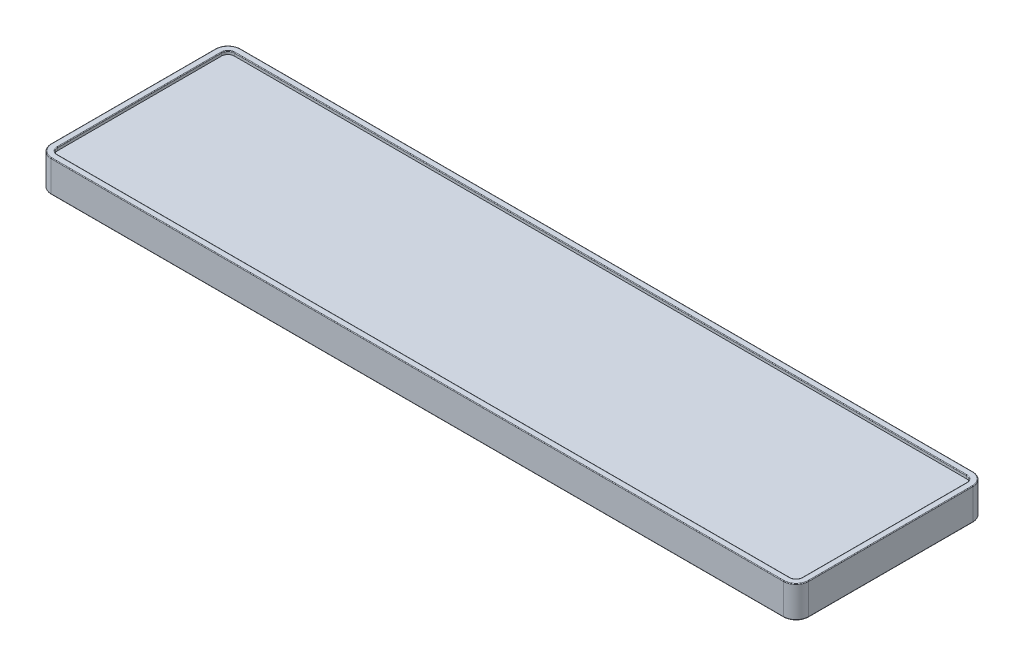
ISO-10303-21;
HEADER;
FILE_DESCRIPTION(('STEP AP214'),'2;1');
FILE_NAME('part.step','',(''),(''),'','','');
FILE_SCHEMA(('AUTOMOTIVE_DESIGN { 1 0 10303 214 1 1 1 1 }'));
ENDSEC;
DATA;
#1=APPLICATION_CONTEXT('core data for automotive mechanical design processes');
#2=APPLICATION_PROTOCOL_DEFINITION('international standard','automotive_design',2000,#1);
#3=PRODUCT_CONTEXT('',#1,'mechanical');
#4=PRODUCT('Part','Part','',(#3));
#5=PRODUCT_RELATED_PRODUCT_CATEGORY('part','',(#4));
#6=PRODUCT_DEFINITION_FORMATION('','',#4);
#7=PRODUCT_DEFINITION_CONTEXT('part definition',#1,'design');
#8=PRODUCT_DEFINITION('design','',#6,#7);
#9=PRODUCT_DEFINITION_SHAPE('','',#8);
#10=(LENGTH_UNIT() NAMED_UNIT(*) SI_UNIT(.MILLI.,.METRE.));
#11=(NAMED_UNIT(*) PLANE_ANGLE_UNIT() SI_UNIT($,.RADIAN.));
#12=(NAMED_UNIT(*) SI_UNIT($,.STERADIAN.) SOLID_ANGLE_UNIT());
#13=UNCERTAINTY_MEASURE_WITH_UNIT(LENGTH_MEASURE(1.E-05),#10,'distance_accuracy_value','');
#14=(GEOMETRIC_REPRESENTATION_CONTEXT(3) GLOBAL_UNCERTAINTY_ASSIGNED_CONTEXT((#13)) GLOBAL_UNIT_ASSIGNED_CONTEXT((#10,
#11,#12)) REPRESENTATION_CONTEXT('',''));
#15=CARTESIAN_POINT('',(0.,0.,0.));
#16=DIRECTION('',(0.,0.,1.));
#17=DIRECTION('',(1.,0.,0.));
#18=AXIS2_PLACEMENT_3D('',#15,#16,#17);
#19=CARTESIAN_POINT('',(-580.,0.,130.));
#20=DIRECTION('',(0.,-1.,0.));
#21=DIRECTION('',(0.,0.,-1.));
#22=AXIS2_PLACEMENT_3D('',#19,#20,#21);
#23=PLANE('',#22);
#24=DIRECTION('',(-1.,0.,0.));
#25=VECTOR('',#24,1.);
#26=CARTESIAN_POINT('',(-580.,0.,-141.));
#27=LINE('',#26,#25);
#28=CARTESIAN_POINT('',(580.,0.,-141.));
#29=VERTEX_POINT('',#28);
#30=CARTESIAN_POINT('',(-580.,0.,-141.));
#31=VERTEX_POINT('',#30);
#32=EDGE_CURVE('E671',#29,#31,#27,.T.);
#33=ORIENTED_EDGE('',*,*,#32,.T.);
#34=CARTESIAN_POINT('',(-580.,0.,-130.));
#35=DIRECTION('',(0.,-1.,0.));
#36=DIRECTION('',(0.,0.,-1.));
#37=AXIS2_PLACEMENT_3D('',#34,#35,#36);
#38=CIRCLE('',#37,11.);
#39=CARTESIAN_POINT('',(-591.,0.,-130.));
#40=VERTEX_POINT('',#39);
#41=EDGE_CURVE('E674',#31,#40,#38,.F.);
#42=ORIENTED_EDGE('',*,*,#41,.T.);
#43=DIRECTION('',(0.,0.,1.));
#44=VECTOR('',#43,1.);
#45=CARTESIAN_POINT('',(-591.,0.,130.));
#46=LINE('',#45,#44);
#47=CARTESIAN_POINT('',(-591.,0.,130.));
#48=VERTEX_POINT('',#47);
#49=EDGE_CURVE('E653',#40,#48,#46,.T.);
#50=ORIENTED_EDGE('',*,*,#49,.T.);
#51=CARTESIAN_POINT('',(-580.,0.,130.));
#52=DIRECTION('',(0.,-1.,0.));
#53=DIRECTION('',(0.,0.,-1.));
#54=AXIS2_PLACEMENT_3D('',#51,#52,#53);
#55=CIRCLE('',#54,11.);
#56=CARTESIAN_POINT('',(-580.,0.,141.));
#57=VERTEX_POINT('',#56);
#58=EDGE_CURVE('E656',#48,#57,#55,.F.);
#59=ORIENTED_EDGE('',*,*,#58,.T.);
#60=DIRECTION('',(1.,0.,0.));
#61=VECTOR('',#60,1.);
#62=CARTESIAN_POINT('',(-580.,0.,141.));
#63=LINE('',#62,#61);
#64=CARTESIAN_POINT('',(580.,0.,141.));
#65=VERTEX_POINT('',#64);
#66=EDGE_CURVE('E659',#57,#65,#63,.T.);
#67=ORIENTED_EDGE('',*,*,#66,.T.);
#68=CARTESIAN_POINT('',(580.,0.,130.));
#69=DIRECTION('',(0.,-1.,0.));
#70=DIRECTION('',(0.,0.,-1.));
#71=AXIS2_PLACEMENT_3D('',#68,#69,#70);
#72=CIRCLE('',#71,11.);
#73=CARTESIAN_POINT('',(591.,0.,130.));
#74=VERTEX_POINT('',#73);
#75=EDGE_CURVE('E662',#65,#74,#72,.F.);
#76=ORIENTED_EDGE('',*,*,#75,.T.);
#77=DIRECTION('',(0.,0.,-1.));
#78=VECTOR('',#77,1.);
#79=CARTESIAN_POINT('',(591.,0.,130.));
#80=LINE('',#79,#78);
#81=CARTESIAN_POINT('',(591.,0.,-130.));
#82=VERTEX_POINT('',#81);
#83=EDGE_CURVE('E665',#74,#82,#80,.T.);
#84=ORIENTED_EDGE('',*,*,#83,.T.);
#85=CARTESIAN_POINT('',(580.,0.,-130.));
#86=DIRECTION('',(0.,-1.,0.));
#87=DIRECTION('',(0.,0.,-1.));
#88=AXIS2_PLACEMENT_3D('',#85,#86,#87);
#89=CIRCLE('',#88,11.0000000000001);
#90=EDGE_CURVE('E668',#82,#29,#89,.F.);
#91=ORIENTED_EDGE('',*,*,#90,.T.);
#92=EDGE_LOOP('',(#33,#42,#50,#59,#67,#76,#84,#91));
#93=FACE_BOUND('',#92,.T.);
#94=CARTESIAN_POINT('',(580.,0.,130.));
#95=DIRECTION('',(0.,-1.,0.));
#96=DIRECTION('',(0.,0.,-1.));
#97=AXIS2_PLACEMENT_3D('',#94,#95,#96);
#98=CIRCLE('',#97,19.);
#99=CARTESIAN_POINT('',(599.,0.,130.));
#100=VERTEX_POINT('',#99);
#101=CARTESIAN_POINT('',(580.,0.,149.));
#102=VERTEX_POINT('',#101);
#103=EDGE_CURVE('E646',#100,#102,#98,.T.);
#104=ORIENTED_EDGE('',*,*,#103,.T.);
#105=DIRECTION('',(1.,0.,0.));
#106=VECTOR('',#105,1.);
#107=CARTESIAN_POINT('',(-580.,0.,149.));
#108=LINE('',#107,#106);
#109=CARTESIAN_POINT('',(-580.,0.,149.));
#110=VERTEX_POINT('',#109);
#111=EDGE_CURVE('E649',#102,#110,#108,.F.);
#112=ORIENTED_EDGE('',*,*,#111,.T.);
#113=CARTESIAN_POINT('',(-580.,0.,130.));
#114=DIRECTION('',(0.,-1.,0.));
#115=DIRECTION('',(0.,0.,-1.));
#116=AXIS2_PLACEMENT_3D('',#113,#114,#115);
#117=CIRCLE('',#116,19.);
#118=CARTESIAN_POINT('',(-599.,0.,130.));
#119=VERTEX_POINT('',#118);
#120=EDGE_CURVE('E568',#110,#119,#117,.T.);
#121=ORIENTED_EDGE('',*,*,#120,.T.);
#122=DIRECTION('',(0.,0.,1.));
#123=VECTOR('',#122,1.);
#124=CARTESIAN_POINT('',(-599.,0.,-130.));
#125=LINE('',#124,#123);
#126=CARTESIAN_POINT('',(-599.,0.,-130.));
#127=VERTEX_POINT('',#126);
#128=EDGE_CURVE('E631',#119,#127,#125,.F.);
#129=ORIENTED_EDGE('',*,*,#128,.T.);
#130=CARTESIAN_POINT('',(-580.,0.,-130.));
#131=DIRECTION('',(0.,-1.,0.));
#132=DIRECTION('',(0.,0.,-1.));
#133=AXIS2_PLACEMENT_3D('',#130,#131,#132);
#134=CIRCLE('',#133,19.);
#135=CARTESIAN_POINT('',(-580.,0.,-149.));
#136=VERTEX_POINT('',#135);
#137=EDGE_CURVE('E634',#127,#136,#134,.T.);
#138=ORIENTED_EDGE('',*,*,#137,.T.);
#139=DIRECTION('',(-1.,0.,0.));
#140=VECTOR('',#139,1.);
#141=CARTESIAN_POINT('',(580.,0.,-149.));
#142=LINE('',#141,#140);
#143=CARTESIAN_POINT('',(580.,0.,-149.));
#144=VERTEX_POINT('',#143);
#145=EDGE_CURVE('E637',#136,#144,#142,.F.);
#146=ORIENTED_EDGE('',*,*,#145,.T.);
#147=CARTESIAN_POINT('',(580.,0.,-130.));
#148=DIRECTION('',(0.,-1.,0.));
#149=DIRECTION('',(0.,0.,-1.));
#150=AXIS2_PLACEMENT_3D('',#147,#148,#149);
#151=CIRCLE('',#150,19.0000000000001);
#152=CARTESIAN_POINT('',(599.,0.,-130.));
#153=VERTEX_POINT('',#152);
#154=EDGE_CURVE('E640',#144,#153,#151,.T.);
#155=ORIENTED_EDGE('',*,*,#154,.T.);
#156=DIRECTION('',(0.,0.,-1.));
#157=VECTOR('',#156,1.);
#158=CARTESIAN_POINT('',(599.,0.,130.));
#159=LINE('',#158,#157);
#160=EDGE_CURVE('E643',#153,#100,#159,.F.);
#161=ORIENTED_EDGE('',*,*,#160,.T.);
#162=EDGE_LOOP('',(#104,#112,#121,#129,#138,#146,#155,#161));
#163=FACE_BOUND('',#162,.T.);
#164=ADVANCED_FACE('F39',(#93,#163),#23,.T.);
#165=CARTESIAN_POINT('',(-580.,50.,130.));
#166=DIRECTION('',(0.,-1.,0.));
#167=DIRECTION('',(0.,0.,-1.));
#168=AXIS2_PLACEMENT_3D('',#165,#166,#167);
#169=CYLINDRICAL_SURFACE('',#168,20.);
#170=DIRECTION('',(0.,-1.,0.));
#171=VECTOR('',#170,1.);
#172=CARTESIAN_POINT('',(-600.,50.,130.));
#173=LINE('',#172,#171);
#174=CARTESIAN_POINT('',(-600.,49.,130.));
#175=VERTEX_POINT('',#174);
#176=CARTESIAN_POINT('',(-600.,1.,130.));
#177=VERTEX_POINT('',#176);
#178=EDGE_CURVE('E412',#175,#177,#173,.T.);
#179=ORIENTED_EDGE('',*,*,#178,.T.);
#180=CARTESIAN_POINT('',(-580.,1.,130.));
#181=DIRECTION('',(0.,-1.,0.));
#182=DIRECTION('',(0.,0.,-1.));
#183=AXIS2_PLACEMENT_3D('',#180,#181,#182);
#184=CIRCLE('',#183,20.);
#185=CARTESIAN_POINT('',(-580.,1.,150.));
#186=VERTEX_POINT('',#185);
#187=EDGE_CURVE('E11',#177,#186,#184,.F.);
#188=ORIENTED_EDGE('',*,*,#187,.T.);
#189=DIRECTION('',(0.,-1.,0.));
#190=VECTOR('',#189,1.);
#191=CARTESIAN_POINT('',(-580.,50.,150.));
#192=LINE('',#191,#190);
#193=CARTESIAN_POINT('',(-580.,49.,150.));
#194=VERTEX_POINT('',#193);
#195=EDGE_CURVE('E464',#194,#186,#192,.T.);
#196=ORIENTED_EDGE('',*,*,#195,.F.);
#197=CARTESIAN_POINT('',(-580.,49.,130.));
#198=DIRECTION('',(0.,-1.,0.));
#199=DIRECTION('',(0.,0.,-1.));
#200=AXIS2_PLACEMENT_3D('',#197,#198,#199);
#201=CIRCLE('',#200,20.);
#202=EDGE_CURVE('E540',#194,#175,#201,.T.);
#203=ORIENTED_EDGE('',*,*,#202,.T.);
#204=EDGE_LOOP('',(#179,#188,#196,#203));
#205=FACE_BOUND('',#204,.T.);
#206=ADVANCED_FACE('F803',(#205),#169,.T.);
#207=CARTESIAN_POINT('',(-580.,50.,150.));
#208=DIRECTION('',(0.,0.,-1.));
#209=DIRECTION('',(-1.,0.,0.));
#210=AXIS2_PLACEMENT_3D('',#207,#208,#209);
#211=PLANE('',#210);
#212=ORIENTED_EDGE('',*,*,#195,.T.);
#213=DIRECTION('',(1.,0.,0.));
#214=VECTOR('',#213,1.);
#215=CARTESIAN_POINT('',(580.,1.,150.));
#216=LINE('',#215,#214);
#217=CARTESIAN_POINT('',(580.,1.,150.));
#218=VERTEX_POINT('',#217);
#219=EDGE_CURVE('E702',#186,#218,#216,.T.);
#220=ORIENTED_EDGE('',*,*,#219,.T.);
#221=DIRECTION('',(0.,-1.,0.));
#222=VECTOR('',#221,1.);
#223=CARTESIAN_POINT('',(580.,50.,150.));
#224=LINE('',#223,#222);
#225=CARTESIAN_POINT('',(580.,49.,150.));
#226=VERTEX_POINT('',#225);
#227=EDGE_CURVE('E460',#226,#218,#224,.T.);
#228=ORIENTED_EDGE('',*,*,#227,.F.);
#229=DIRECTION('',(1.,0.,0.));
#230=VECTOR('',#229,1.);
#231=CARTESIAN_POINT('',(-580.,49.,150.));
#232=LINE('',#231,#230);
#233=EDGE_CURVE('E537',#226,#194,#232,.F.);
#234=ORIENTED_EDGE('',*,*,#233,.T.);
#235=EDGE_LOOP('',(#212,#220,#228,#234));
#236=FACE_BOUND('',#235,.T.);
#237=ADVANCED_FACE('F806',(#236),#211,.F.);
#238=CARTESIAN_POINT('',(580.,50.,130.));
#239=DIRECTION('',(0.,-1.,0.));
#240=DIRECTION('',(0.,0.,-1.));
#241=AXIS2_PLACEMENT_3D('',#238,#239,#240);
#242=CYLINDRICAL_SURFACE('',#241,20.);
#243=ORIENTED_EDGE('',*,*,#227,.T.);
#244=CARTESIAN_POINT('',(580.,1.,130.));
#245=DIRECTION('',(0.,-1.,0.));
#246=DIRECTION('',(0.,0.,-1.));
#247=AXIS2_PLACEMENT_3D('',#244,#245,#246);
#248=CIRCLE('',#247,20.);
#249=CARTESIAN_POINT('',(600.,1.,130.));
#250=VERTEX_POINT('',#249);
#251=EDGE_CURVE('E706',#218,#250,#248,.F.);
#252=ORIENTED_EDGE('',*,*,#251,.T.);
#253=DIRECTION('',(0.,-1.,0.));
#254=VECTOR('',#253,1.);
#255=CARTESIAN_POINT('',(600.,50.,130.));
#256=LINE('',#255,#254);
#257=CARTESIAN_POINT('',(600.,49.,130.));
#258=VERTEX_POINT('',#257);
#259=EDGE_CURVE('E456',#258,#250,#256,.T.);
#260=ORIENTED_EDGE('',*,*,#259,.F.);
#261=CARTESIAN_POINT('',(580.,49.,130.));
#262=DIRECTION('',(0.,-1.,0.));
#263=DIRECTION('',(0.,0.,-1.));
#264=AXIS2_PLACEMENT_3D('',#261,#262,#263);
#265=CIRCLE('',#264,20.);
#266=EDGE_CURVE('E534',#258,#226,#265,.T.);
#267=ORIENTED_EDGE('',*,*,#266,.T.);
#268=EDGE_LOOP('',(#243,#252,#260,#267));
#269=FACE_BOUND('',#268,.T.);
#270=ADVANCED_FACE('F861',(#269),#242,.T.);
#271=CARTESIAN_POINT('',(600.,50.,130.));
#272=DIRECTION('',(-1.,0.,0.));
#273=DIRECTION('',(0.,0.,1.));
#274=AXIS2_PLACEMENT_3D('',#271,#272,#273);
#275=PLANE('',#274);
#276=ORIENTED_EDGE('',*,*,#259,.T.);
#277=DIRECTION('',(0.,0.,-1.));
#278=VECTOR('',#277,1.);
#279=CARTESIAN_POINT('',(600.,1.,-130.));
#280=LINE('',#279,#278);
#281=CARTESIAN_POINT('',(600.,1.,-130.));
#282=VERTEX_POINT('',#281);
#283=EDGE_CURVE('E709',#250,#282,#280,.T.);
#284=ORIENTED_EDGE('',*,*,#283,.T.);
#285=DIRECTION('',(0.,-1.,0.));
#286=VECTOR('',#285,1.);
#287=CARTESIAN_POINT('',(600.,50.,-130.));
#288=LINE('',#287,#286);
#289=CARTESIAN_POINT('',(600.,49.,-130.));
#290=VERTEX_POINT('',#289);
#291=EDGE_CURVE('E452',#290,#282,#288,.T.);
#292=ORIENTED_EDGE('',*,*,#291,.F.);
#293=DIRECTION('',(0.,0.,-1.));
#294=VECTOR('',#293,1.);
#295=CARTESIAN_POINT('',(600.,49.,130.));
#296=LINE('',#295,#294);
#297=EDGE_CURVE('E531',#290,#258,#296,.F.);
#298=ORIENTED_EDGE('',*,*,#297,.T.);
#299=EDGE_LOOP('',(#276,#284,#292,#298));
#300=FACE_BOUND('',#299,.T.);
#301=ADVANCED_FACE('F849',(#300),#275,.F.);
#302=CARTESIAN_POINT('',(580.,50.,-130.));
#303=DIRECTION('',(0.,-1.,0.));
#304=DIRECTION('',(0.,0.,-1.));
#305=AXIS2_PLACEMENT_3D('',#302,#303,#304);
#306=CYLINDRICAL_SURFACE('',#305,20.0000000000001);
#307=ORIENTED_EDGE('',*,*,#291,.T.);
#308=CARTESIAN_POINT('',(580.,1.,-130.));
#309=DIRECTION('',(0.,-1.,0.));
#310=DIRECTION('',(0.,0.,-1.));
#311=AXIS2_PLACEMENT_3D('',#308,#309,#310);
#312=CIRCLE('',#311,20.0000000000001);
#313=CARTESIAN_POINT('',(580.,1.,-150.));
#314=VERTEX_POINT('',#313);
#315=EDGE_CURVE('E712',#282,#314,#312,.F.);
#316=ORIENTED_EDGE('',*,*,#315,.T.);
#317=DIRECTION('',(0.,-1.,0.));
#318=VECTOR('',#317,1.);
#319=CARTESIAN_POINT('',(580.,50.,-150.));
#320=LINE('',#319,#318);
#321=CARTESIAN_POINT('',(580.,49.,-150.));
#322=VERTEX_POINT('',#321);
#323=EDGE_CURVE('E448',#322,#314,#320,.T.);
#324=ORIENTED_EDGE('',*,*,#323,.F.);
#325=CARTESIAN_POINT('',(580.,49.,-130.));
#326=DIRECTION('',(0.,-1.,0.));
#327=DIRECTION('',(0.,0.,-1.));
#328=AXIS2_PLACEMENT_3D('',#325,#326,#327);
#329=CIRCLE('',#328,20.0000000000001);
#330=EDGE_CURVE('E528',#322,#290,#329,.T.);
#331=ORIENTED_EDGE('',*,*,#330,.T.);
#332=EDGE_LOOP('',(#307,#316,#324,#331));
#333=FACE_BOUND('',#332,.T.);
#334=ADVANCED_FACE('F846',(#333),#306,.T.);
#335=CARTESIAN_POINT('',(-580.,50.,-150.));
#336=DIRECTION('',(0.,0.,1.));
#337=DIRECTION('',(1.,0.,0.));
#338=AXIS2_PLACEMENT_3D('',#335,#336,#337);
#339=PLANE('',#338);
#340=ORIENTED_EDGE('',*,*,#323,.T.);
#341=DIRECTION('',(-1.,0.,0.));
#342=VECTOR('',#341,1.);
#343=CARTESIAN_POINT('',(-580.,1.,-150.));
#344=LINE('',#343,#342);
#345=CARTESIAN_POINT('',(-580.,1.,-150.));
#346=VERTEX_POINT('',#345);
#347=EDGE_CURVE('E715',#314,#346,#344,.T.);
#348=ORIENTED_EDGE('',*,*,#347,.T.);
#349=DIRECTION('',(0.,-1.,0.));
#350=VECTOR('',#349,1.);
#351=CARTESIAN_POINT('',(-580.,50.,-150.));
#352=LINE('',#351,#350);
#353=CARTESIAN_POINT('',(-580.,49.,-150.));
#354=VERTEX_POINT('',#353);
#355=EDGE_CURVE('E445',#354,#346,#352,.T.);
#356=ORIENTED_EDGE('',*,*,#355,.F.);
#357=DIRECTION('',(-1.,0.,0.));
#358=VECTOR('',#357,1.);
#359=CARTESIAN_POINT('',(-580.,49.,-150.));
#360=LINE('',#359,#358);
#361=EDGE_CURVE('E525',#354,#322,#360,.F.);
#362=ORIENTED_EDGE('',*,*,#361,.T.);
#363=EDGE_LOOP('',(#340,#348,#356,#362));
#364=FACE_BOUND('',#363,.T.);
#365=ADVANCED_FACE('F833',(#364),#339,.F.);
#366=CARTESIAN_POINT('',(-580.,50.,-130.));
#367=DIRECTION('',(0.,-1.,0.));
#368=DIRECTION('',(0.,0.,-1.));
#369=AXIS2_PLACEMENT_3D('',#366,#367,#368);
#370=CYLINDRICAL_SURFACE('',#369,20.);
#371=ORIENTED_EDGE('',*,*,#355,.T.);
#372=CARTESIAN_POINT('',(-580.,1.,-130.));
#373=DIRECTION('',(0.,-1.,0.));
#374=DIRECTION('',(0.,0.,-1.));
#375=AXIS2_PLACEMENT_3D('',#372,#373,#374);
#376=CIRCLE('',#375,20.);
#377=CARTESIAN_POINT('',(-600.,1.,-130.));
#378=VERTEX_POINT('',#377);
#379=EDGE_CURVE('E64',#346,#378,#376,.F.);
#380=ORIENTED_EDGE('',*,*,#379,.T.);
#381=DIRECTION('',(0.,-1.,0.));
#382=VECTOR('',#381,1.);
#383=CARTESIAN_POINT('',(-600.,50.,-130.));
#384=LINE('',#383,#382);
#385=CARTESIAN_POINT('',(-600.,49.,-130.));
#386=VERTEX_POINT('',#385);
#387=EDGE_CURVE('E442',#386,#378,#384,.T.);
#388=ORIENTED_EDGE('',*,*,#387,.F.);
#389=CARTESIAN_POINT('',(-580.,49.,-130.));
#390=DIRECTION('',(0.,-1.,0.));
#391=DIRECTION('',(0.,0.,-1.));
#392=AXIS2_PLACEMENT_3D('',#389,#390,#391);
#393=CIRCLE('',#392,20.);
#394=EDGE_CURVE('E522',#386,#354,#393,.T.);
#395=ORIENTED_EDGE('',*,*,#394,.T.);
#396=EDGE_LOOP('',(#371,#380,#388,#395));
#397=FACE_BOUND('',#396,.T.);
#398=ADVANCED_FACE('F830',(#397),#370,.T.);
#399=CARTESIAN_POINT('',(-600.,50.,130.));
#400=DIRECTION('',(1.,0.,0.));
#401=DIRECTION('',(0.,0.,-1.));
#402=AXIS2_PLACEMENT_3D('',#399,#400,#401);
#403=PLANE('',#402);
#404=ORIENTED_EDGE('',*,*,#387,.T.);
#405=DIRECTION('',(0.,0.,1.));
#406=VECTOR('',#405,1.);
#407=CARTESIAN_POINT('',(-600.,1.,130.));
#408=LINE('',#407,#406);
#409=EDGE_CURVE('E49',#378,#177,#408,.T.);
#410=ORIENTED_EDGE('',*,*,#409,.T.);
#411=ORIENTED_EDGE('',*,*,#178,.F.);
#412=DIRECTION('',(0.,0.,1.));
#413=VECTOR('',#412,1.);
#414=CARTESIAN_POINT('',(-600.,49.,130.));
#415=LINE('',#414,#413);
#416=EDGE_CURVE('E518',#175,#386,#415,.F.);
#417=ORIENTED_EDGE('',*,*,#416,.T.);
#418=EDGE_LOOP('',(#404,#410,#411,#417));
#419=FACE_BOUND('',#418,.T.);
#420=ADVANCED_FACE('F819',(#419),#403,.F.);
#421=CARTESIAN_POINT('',(-580.,50.,130.));
#422=DIRECTION('',(0.,-1.,0.));
#423=DIRECTION('',(0.,0.,-1.));
#424=AXIS2_PLACEMENT_3D('',#421,#422,#423);
#425=PLANE('',#424);
#426=CARTESIAN_POINT('',(-580.,50.,-130.));
#427=DIRECTION('',(0.,-1.,0.));
#428=DIRECTION('',(0.,0.,-1.));
#429=AXIS2_PLACEMENT_3D('',#426,#427,#428);
#430=CIRCLE('',#429,19.);
#431=CARTESIAN_POINT('',(-580.,50.,-149.));
#432=VERTEX_POINT('',#431);
#433=CARTESIAN_POINT('',(-599.,50.,-130.));
#434=VERTEX_POINT('',#433);
#435=EDGE_CURVE('E511',#432,#434,#430,.F.);
#436=ORIENTED_EDGE('',*,*,#435,.T.);
#437=DIRECTION('',(0.,0.,1.));
#438=VECTOR('',#437,1.);
#439=CARTESIAN_POINT('',(-599.,50.,130.));
#440=LINE('',#439,#438);
#441=CARTESIAN_POINT('',(-599.,50.,130.));
#442=VERTEX_POINT('',#441);
#443=EDGE_CURVE('E514',#434,#442,#440,.T.);
#444=ORIENTED_EDGE('',*,*,#443,.T.);
#445=CARTESIAN_POINT('',(-580.,50.,130.));
#446=DIRECTION('',(0.,-1.,0.));
#447=DIRECTION('',(0.,0.,-1.));
#448=AXIS2_PLACEMENT_3D('',#445,#446,#447);
#449=CIRCLE('',#448,19.);
#450=CARTESIAN_POINT('',(-580.,50.,149.));
#451=VERTEX_POINT('',#450);
#452=EDGE_CURVE('E493',#442,#451,#449,.F.);
#453=ORIENTED_EDGE('',*,*,#452,.T.);
#454=DIRECTION('',(1.,0.,0.));
#455=VECTOR('',#454,1.);
#456=CARTESIAN_POINT('',(-580.,50.,149.));
#457=LINE('',#456,#455);
#458=CARTESIAN_POINT('',(580.,50.,149.));
#459=VERTEX_POINT('',#458);
#460=EDGE_CURVE('E496',#451,#459,#457,.T.);
#461=ORIENTED_EDGE('',*,*,#460,.T.);
#462=CARTESIAN_POINT('',(580.,50.,130.));
#463=DIRECTION('',(0.,-1.,0.));
#464=DIRECTION('',(0.,0.,-1.));
#465=AXIS2_PLACEMENT_3D('',#462,#463,#464);
#466=CIRCLE('',#465,19.);
#467=CARTESIAN_POINT('',(599.,50.,130.));
#468=VERTEX_POINT('',#467);
#469=EDGE_CURVE('E499',#459,#468,#466,.F.);
#470=ORIENTED_EDGE('',*,*,#469,.T.);
#471=DIRECTION('',(0.,0.,-1.));
#472=VECTOR('',#471,1.);
#473=CARTESIAN_POINT('',(599.,50.,130.));
#474=LINE('',#473,#472);
#475=CARTESIAN_POINT('',(599.,50.,-130.));
#476=VERTEX_POINT('',#475);
#477=EDGE_CURVE('E502',#468,#476,#474,.T.);
#478=ORIENTED_EDGE('',*,*,#477,.T.);
#479=CARTESIAN_POINT('',(580.,50.,-130.));
#480=DIRECTION('',(0.,-1.,0.));
#481=DIRECTION('',(0.,0.,-1.));
#482=AXIS2_PLACEMENT_3D('',#479,#480,#481);
#483=CIRCLE('',#482,19.0000000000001);
#484=CARTESIAN_POINT('',(580.,50.,-149.));
#485=VERTEX_POINT('',#484);
#486=EDGE_CURVE('E505',#476,#485,#483,.F.);
#487=ORIENTED_EDGE('',*,*,#486,.T.);
#488=DIRECTION('',(-1.,0.,0.));
#489=VECTOR('',#488,1.);
#490=CARTESIAN_POINT('',(-580.,50.,-149.));
#491=LINE('',#490,#489);
#492=EDGE_CURVE('E508',#485,#432,#491,.T.);
#493=ORIENTED_EDGE('',*,*,#492,.T.);
#494=EDGE_LOOP('',(#436,#444,#453,#461,#470,#478,#487,#493));
#495=FACE_BOUND('',#494,.T.);
#496=DIRECTION('',(0.,0.,-1.));
#497=VECTOR('',#496,1.);
#498=CARTESIAN_POINT('',(591.,50.,130.000000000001));
#499=LINE('',#498,#497);
#500=CARTESIAN_POINT('',(591.,50.,-130.));
#501=VERTEX_POINT('',#500);
#502=CARTESIAN_POINT('',(591.,50.,130.));
#503=VERTEX_POINT('',#502);
#504=EDGE_CURVE('E486',#501,#503,#499,.F.);
#505=ORIENTED_EDGE('',*,*,#504,.T.);
#506=CARTESIAN_POINT('',(580.,50.,130.));
#507=DIRECTION('',(0.,-1.,0.));
#508=DIRECTION('',(0.,0.,-1.));
#509=AXIS2_PLACEMENT_3D('',#506,#507,#508);
#510=CIRCLE('',#509,11.);
#511=CARTESIAN_POINT('',(580.,50.,141.));
#512=VERTEX_POINT('',#511);
#513=EDGE_CURVE('E489',#503,#512,#510,.T.);
#514=ORIENTED_EDGE('',*,*,#513,.T.);
#515=DIRECTION('',(1.,0.,0.));
#516=VECTOR('',#515,1.);
#517=CARTESIAN_POINT('',(-580.,50.,141.));
#518=LINE('',#517,#516);
#519=CARTESIAN_POINT('',(-580.,50.,141.));
#520=VERTEX_POINT('',#519);
#521=EDGE_CURVE('E468',#512,#520,#518,.F.);
#522=ORIENTED_EDGE('',*,*,#521,.T.);
#523=CARTESIAN_POINT('',(-580.,50.,130.));
#524=DIRECTION('',(0.,-1.,0.));
#525=DIRECTION('',(0.,0.,-1.));
#526=AXIS2_PLACEMENT_3D('',#523,#524,#525);
#527=CIRCLE('',#526,11.);
#528=CARTESIAN_POINT('',(-591.,50.,130.));
#529=VERTEX_POINT('',#528);
#530=EDGE_CURVE('E471',#520,#529,#527,.T.);
#531=ORIENTED_EDGE('',*,*,#530,.T.);
#532=DIRECTION('',(0.,0.,1.));
#533=VECTOR('',#532,1.);
#534=CARTESIAN_POINT('',(-591.,50.,130.));
#535=LINE('',#534,#533);
#536=CARTESIAN_POINT('',(-591.,50.,-130.));
#537=VERTEX_POINT('',#536);
#538=EDGE_CURVE('E474',#529,#537,#535,.F.);
#539=ORIENTED_EDGE('',*,*,#538,.T.);
#540=CARTESIAN_POINT('',(-580.,50.,-130.));
#541=DIRECTION('',(0.,-1.,0.));
#542=DIRECTION('',(0.,0.,-1.));
#543=AXIS2_PLACEMENT_3D('',#540,#541,#542);
#544=CIRCLE('',#543,11.);
#545=CARTESIAN_POINT('',(-580.,50.,-141.));
#546=VERTEX_POINT('',#545);
#547=EDGE_CURVE('E477',#537,#546,#544,.T.);
#548=ORIENTED_EDGE('',*,*,#547,.T.);
#549=DIRECTION('',(-1.,0.,0.));
#550=VECTOR('',#549,1.);
#551=CARTESIAN_POINT('',(-580.,50.,-141.));
#552=LINE('',#551,#550);
#553=CARTESIAN_POINT('',(580.,50.,-141.));
#554=VERTEX_POINT('',#553);
#555=EDGE_CURVE('E480',#546,#554,#552,.F.);
#556=ORIENTED_EDGE('',*,*,#555,.T.);
#557=CARTESIAN_POINT('',(580.,50.,-130.));
#558=DIRECTION('',(0.,-1.,0.));
#559=DIRECTION('',(0.,0.,-1.));
#560=AXIS2_PLACEMENT_3D('',#557,#558,#559);
#561=CIRCLE('',#560,11.0000000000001);
#562=EDGE_CURVE('E483',#554,#501,#561,.T.);
#563=ORIENTED_EDGE('',*,*,#562,.T.);
#564=EDGE_LOOP('',(#505,#514,#522,#531,#539,#548,#556,#563));
#565=FACE_BOUND('',#564,.T.);
#566=ADVANCED_FACE('F890',(#495,#565),#425,.F.);
#567=CARTESIAN_POINT('',(-580.,45.,130.));
#568=DIRECTION('',(0.,1.,0.));
#569=DIRECTION('',(0.,0.,1.));
#570=AXIS2_PLACEMENT_3D('',#567,#568,#569);
#571=CYLINDRICAL_SURFACE('',#570,9.99999999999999);
#572=DIRECTION('',(0.,1.,0.));
#573=VECTOR('',#572,1.);
#574=CARTESIAN_POINT('',(-590.,45.,130.));
#575=LINE('',#574,#573);
#576=CARTESIAN_POINT('',(-590.,45.,130.));
#577=VERTEX_POINT('',#576);
#578=CARTESIAN_POINT('',(-590.,49.,130.));
#579=VERTEX_POINT('',#578);
#580=EDGE_CURVE('E408',#577,#579,#575,.T.);
#581=ORIENTED_EDGE('',*,*,#580,.T.);
#582=CARTESIAN_POINT('',(-580.,49.,130.));
#583=DIRECTION('',(0.,-1.,0.));
#584=DIRECTION('',(0.,0.,-1.));
#585=AXIS2_PLACEMENT_3D('',#582,#583,#584);
#586=CIRCLE('',#585,9.99999999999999);
#587=CARTESIAN_POINT('',(-580.,49.,140.));
#588=VERTEX_POINT('',#587);
#589=EDGE_CURVE('E562',#579,#588,#586,.F.);
#590=ORIENTED_EDGE('',*,*,#589,.T.);
#591=DIRECTION('',(0.,1.,0.));
#592=VECTOR('',#591,1.);
#593=CARTESIAN_POINT('',(-580.,45.,140.));
#594=LINE('',#593,#592);
#595=CARTESIAN_POINT('',(-580.,45.,140.));
#596=VERTEX_POINT('',#595);
#597=EDGE_CURVE('E407',#596,#588,#594,.T.);
#598=ORIENTED_EDGE('',*,*,#597,.F.);
#599=CARTESIAN_POINT('',(-580.,45.,130.));
#600=DIRECTION('',(0.,1.,0.));
#601=DIRECTION('',(0.,0.,1.));
#602=AXIS2_PLACEMENT_3D('',#599,#600,#601);
#603=CIRCLE('',#602,9.99999999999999);
#604=EDGE_CURVE('E375',#577,#596,#603,.T.);
#605=ORIENTED_EDGE('',*,*,#604,.F.);
#606=EDGE_LOOP('',(#581,#590,#598,#605));
#607=FACE_BOUND('',#606,.T.);
#608=ADVANCED_FACE('F1054',(#607),#571,.F.);
#609=CARTESIAN_POINT('',(-590.,45.,-130.));
#610=DIRECTION('',(-1.,0.,0.));
#611=DIRECTION('',(0.,0.,1.));
#612=AXIS2_PLACEMENT_3D('',#609,#610,#611);
#613=PLANE('',#612);
#614=DIRECTION('',(0.,1.,0.));
#615=VECTOR('',#614,1.);
#616=CARTESIAN_POINT('',(-590.,45.,-130.));
#617=LINE('',#616,#615);
#618=CARTESIAN_POINT('',(-590.,45.,-130.));
#619=VERTEX_POINT('',#618);
#620=CARTESIAN_POINT('',(-590.,49.,-130.));
#621=VERTEX_POINT('',#620);
#622=EDGE_CURVE('E413',#619,#621,#617,.T.);
#623=ORIENTED_EDGE('',*,*,#622,.T.);
#624=DIRECTION('',(0.,0.,1.));
#625=VECTOR('',#624,1.);
#626=CARTESIAN_POINT('',(-590.,49.,-130.));
#627=LINE('',#626,#625);
#628=EDGE_CURVE('E559',#621,#579,#627,.T.);
#629=ORIENTED_EDGE('',*,*,#628,.T.);
#630=ORIENTED_EDGE('',*,*,#580,.F.);
#631=DIRECTION('',(0.,0.,1.));
#632=VECTOR('',#631,1.);
#633=CARTESIAN_POINT('',(-590.,45.,-130.));
#634=LINE('',#633,#632);
#635=EDGE_CURVE('E403',#619,#577,#634,.T.);
#636=ORIENTED_EDGE('',*,*,#635,.F.);
#637=EDGE_LOOP('',(#623,#629,#630,#636));
#638=FACE_BOUND('',#637,.T.);
#639=ADVANCED_FACE('F1050',(#638),#613,.F.);
#640=CARTESIAN_POINT('',(-580.,45.,-130.));
#641=DIRECTION('',(0.,1.,0.));
#642=DIRECTION('',(0.,0.,1.));
#643=AXIS2_PLACEMENT_3D('',#640,#641,#642);
#644=CYLINDRICAL_SURFACE('',#643,10.);
#645=DIRECTION('',(0.,1.,0.));
#646=VECTOR('',#645,1.);
#647=CARTESIAN_POINT('',(-580.,45.,-140.));
#648=LINE('',#647,#646);
#649=CARTESIAN_POINT('',(-580.,45.,-140.));
#650=VERTEX_POINT('',#649);
#651=CARTESIAN_POINT('',(-580.,49.,-140.));
#652=VERTEX_POINT('',#651);
#653=EDGE_CURVE('E417',#650,#652,#648,.T.);
#654=ORIENTED_EDGE('',*,*,#653,.T.);
#655=CARTESIAN_POINT('',(-580.,49.,-130.));
#656=DIRECTION('',(0.,-1.,0.));
#657=DIRECTION('',(0.,0.,-1.));
#658=AXIS2_PLACEMENT_3D('',#655,#656,#657);
#659=CIRCLE('',#658,10.);
#660=EDGE_CURVE('E556',#652,#621,#659,.F.);
#661=ORIENTED_EDGE('',*,*,#660,.T.);
#662=ORIENTED_EDGE('',*,*,#622,.F.);
#663=CARTESIAN_POINT('',(-580.,45.,-130.));
#664=DIRECTION('',(0.,1.,0.));
#665=DIRECTION('',(0.,0.,1.));
#666=AXIS2_PLACEMENT_3D('',#663,#664,#665);
#667=CIRCLE('',#666,10.);
#668=EDGE_CURVE('E399',#650,#619,#667,.T.);
#669=ORIENTED_EDGE('',*,*,#668,.F.);
#670=EDGE_LOOP('',(#654,#661,#662,#669));
#671=FACE_BOUND('',#670,.T.);
#672=ADVANCED_FACE('F1053',(#671),#644,.F.);
#673=CARTESIAN_POINT('',(580.,45.,-140.));
#674=DIRECTION('',(0.,0.,-1.));
#675=DIRECTION('',(-1.,0.,0.));
#676=AXIS2_PLACEMENT_3D('',#673,#674,#675);
#677=PLANE('',#676);
#678=DIRECTION('',(0.,1.,0.));
#679=VECTOR('',#678,1.);
#680=CARTESIAN_POINT('',(580.,45.,-140.));
#681=LINE('',#680,#679);
#682=CARTESIAN_POINT('',(580.,45.,-140.));
#683=VERTEX_POINT('',#682);
#684=CARTESIAN_POINT('',(580.,49.,-140.));
#685=VERTEX_POINT('',#684);
#686=EDGE_CURVE('E421',#683,#685,#681,.T.);
#687=ORIENTED_EDGE('',*,*,#686,.T.);
#688=DIRECTION('',(-1.,0.,0.));
#689=VECTOR('',#688,1.);
#690=CARTESIAN_POINT('',(580.,49.,-140.));
#691=LINE('',#690,#689);
#692=EDGE_CURVE('E553',#685,#652,#691,.T.);
#693=ORIENTED_EDGE('',*,*,#692,.T.);
#694=ORIENTED_EDGE('',*,*,#653,.F.);
#695=DIRECTION('',(-1.,0.,0.));
#696=VECTOR('',#695,1.);
#697=CARTESIAN_POINT('',(580.,45.,-140.));
#698=LINE('',#697,#696);
#699=EDGE_CURVE('E395',#683,#650,#698,.T.);
#700=ORIENTED_EDGE('',*,*,#699,.F.);
#701=EDGE_LOOP('',(#687,#693,#694,#700));
#702=FACE_BOUND('',#701,.T.);
#703=ADVANCED_FACE('F1058',(#702),#677,.F.);
#704=CARTESIAN_POINT('',(580.,45.,-130.));
#705=DIRECTION('',(0.,1.,0.));
#706=DIRECTION('',(0.,0.,1.));
#707=AXIS2_PLACEMENT_3D('',#704,#705,#706);
#708=CYLINDRICAL_SURFACE('',#707,10.0000000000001);
#709=DIRECTION('',(0.,1.,0.));
#710=VECTOR('',#709,1.);
#711=CARTESIAN_POINT('',(590.,45.,-130.));
#712=LINE('',#711,#710);
#713=CARTESIAN_POINT('',(590.,45.,-130.));
#714=VERTEX_POINT('',#713);
#715=CARTESIAN_POINT('',(590.,49.,-130.));
#716=VERTEX_POINT('',#715);
#717=EDGE_CURVE('E425',#714,#716,#712,.T.);
#718=ORIENTED_EDGE('',*,*,#717,.T.);
#719=CARTESIAN_POINT('',(580.,49.,-130.));
#720=DIRECTION('',(0.,-1.,0.));
#721=DIRECTION('',(0.,0.,-1.));
#722=AXIS2_PLACEMENT_3D('',#719,#720,#721);
#723=CIRCLE('',#722,10.0000000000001);
#724=EDGE_CURVE('E550',#716,#685,#723,.F.);
#725=ORIENTED_EDGE('',*,*,#724,.T.);
#726=ORIENTED_EDGE('',*,*,#686,.F.);
#727=CARTESIAN_POINT('',(580.,45.,-130.));
#728=DIRECTION('',(0.,1.,0.));
#729=DIRECTION('',(0.,0.,1.));
#730=AXIS2_PLACEMENT_3D('',#727,#728,#729);
#731=CIRCLE('',#730,10.0000000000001);
#732=EDGE_CURVE('E391',#714,#683,#731,.T.);
#733=ORIENTED_EDGE('',*,*,#732,.F.);
#734=EDGE_LOOP('',(#718,#725,#726,#733));
#735=FACE_BOUND('',#734,.T.);
#736=ADVANCED_FACE('F1062',(#735),#708,.F.);
#737=CARTESIAN_POINT('',(590.,45.,130.));
#738=DIRECTION('',(1.,0.,0.));
#739=DIRECTION('',(0.,0.,-1.));
#740=AXIS2_PLACEMENT_3D('',#737,#738,#739);
#741=PLANE('',#740);
#742=DIRECTION('',(0.,1.,0.));
#743=VECTOR('',#742,1.);
#744=CARTESIAN_POINT('',(590.,45.,130.));
#745=LINE('',#744,#743);
#746=CARTESIAN_POINT('',(590.,45.,130.));
#747=VERTEX_POINT('',#746);
#748=CARTESIAN_POINT('',(590.,49.,130.));
#749=VERTEX_POINT('',#748);
#750=EDGE_CURVE('E429',#747,#749,#745,.T.);
#751=ORIENTED_EDGE('',*,*,#750,.T.);
#752=DIRECTION('',(0.,0.,-1.));
#753=VECTOR('',#752,1.);
#754=CARTESIAN_POINT('',(590.,49.,130.));
#755=LINE('',#754,#753);
#756=EDGE_CURVE('E547',#749,#716,#755,.T.);
#757=ORIENTED_EDGE('',*,*,#756,.T.);
#758=ORIENTED_EDGE('',*,*,#717,.F.);
#759=DIRECTION('',(0.,0.,-1.));
#760=VECTOR('',#759,1.);
#761=CARTESIAN_POINT('',(590.,45.,130.));
#762=LINE('',#761,#760);
#763=EDGE_CURVE('E387',#747,#714,#762,.T.);
#764=ORIENTED_EDGE('',*,*,#763,.F.);
#765=EDGE_LOOP('',(#751,#757,#758,#764));
#766=FACE_BOUND('',#765,.T.);
#767=ADVANCED_FACE('F1066',(#766),#741,.F.);
#768=CARTESIAN_POINT('',(580.,45.,130.));
#769=DIRECTION('',(0.,1.,0.));
#770=DIRECTION('',(0.,0.,1.));
#771=AXIS2_PLACEMENT_3D('',#768,#769,#770);
#772=CYLINDRICAL_SURFACE('',#771,9.99999999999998);
#773=DIRECTION('',(0.,1.,0.));
#774=VECTOR('',#773,1.);
#775=CARTESIAN_POINT('',(580.,45.,140.));
#776=LINE('',#775,#774);
#777=CARTESIAN_POINT('',(580.,45.,140.));
#778=VERTEX_POINT('',#777);
#779=CARTESIAN_POINT('',(580.,49.,140.));
#780=VERTEX_POINT('',#779);
#781=EDGE_CURVE('E433',#778,#780,#776,.T.);
#782=ORIENTED_EDGE('',*,*,#781,.T.);
#783=CARTESIAN_POINT('',(580.,49.,130.));
#784=DIRECTION('',(0.,-1.,0.));
#785=DIRECTION('',(0.,0.,-1.));
#786=AXIS2_PLACEMENT_3D('',#783,#784,#785);
#787=CIRCLE('',#786,9.99999999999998);
#788=EDGE_CURVE('E543',#780,#749,#787,.F.);
#789=ORIENTED_EDGE('',*,*,#788,.T.);
#790=ORIENTED_EDGE('',*,*,#750,.F.);
#791=CARTESIAN_POINT('',(580.,45.,130.));
#792=DIRECTION('',(0.,1.,0.));
#793=DIRECTION('',(0.,0.,1.));
#794=AXIS2_PLACEMENT_3D('',#791,#792,#793);
#795=CIRCLE('',#794,9.99999999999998);
#796=EDGE_CURVE('E383',#778,#747,#795,.T.);
#797=ORIENTED_EDGE('',*,*,#796,.F.);
#798=EDGE_LOOP('',(#782,#789,#790,#797));
#799=FACE_BOUND('',#798,.T.);
#800=ADVANCED_FACE('F1070',(#799),#772,.F.);
#801=CARTESIAN_POINT('',(-580.,45.,140.));
#802=DIRECTION('',(0.,0.,1.));
#803=DIRECTION('',(1.,0.,0.));
#804=AXIS2_PLACEMENT_3D('',#801,#802,#803);
#805=PLANE('',#804);
#806=ORIENTED_EDGE('',*,*,#597,.T.);
#807=DIRECTION('',(1.,0.,0.));
#808=VECTOR('',#807,1.);
#809=CARTESIAN_POINT('',(-580.,49.,140.));
#810=LINE('',#809,#808);
#811=EDGE_CURVE('E565',#588,#780,#810,.T.);
#812=ORIENTED_EDGE('',*,*,#811,.T.);
#813=ORIENTED_EDGE('',*,*,#781,.F.);
#814=DIRECTION('',(1.,0.,0.));
#815=VECTOR('',#814,1.);
#816=CARTESIAN_POINT('',(-580.,45.,140.));
#817=LINE('',#816,#815);
#818=EDGE_CURVE('E379',#596,#778,#817,.T.);
#819=ORIENTED_EDGE('',*,*,#818,.F.);
#820=EDGE_LOOP('',(#806,#812,#813,#819));
#821=FACE_BOUND('',#820,.T.);
#822=ADVANCED_FACE('F1048',(#821),#805,.F.);
#823=CARTESIAN_POINT('',(-580.,45.,130.));
#824=DIRECTION('',(0.,1.,0.));
#825=DIRECTION('',(0.,0.,1.));
#826=AXIS2_PLACEMENT_3D('',#823,#824,#825);
#827=PLANE('',#826);
#828=ORIENTED_EDGE('',*,*,#604,.T.);
#829=ORIENTED_EDGE('',*,*,#818,.T.);
#830=ORIENTED_EDGE('',*,*,#796,.T.);
#831=ORIENTED_EDGE('',*,*,#763,.T.);
#832=ORIENTED_EDGE('',*,*,#732,.T.);
#833=ORIENTED_EDGE('',*,*,#699,.T.);
#834=ORIENTED_EDGE('',*,*,#668,.T.);
#835=ORIENTED_EDGE('',*,*,#635,.T.);
#836=EDGE_LOOP('',(#828,#829,#830,#831,#832,#833,#834,#835));
#837=FACE_BOUND('',#836,.T.);
#838=ADVANCED_FACE('F1045',(#837),#827,.T.);
#839=CARTESIAN_POINT('',(-580.,35.,130.));
#840=DIRECTION('',(0.,1.,0.));
#841=DIRECTION('',(0.,0.,1.));
#842=AXIS2_PLACEMENT_3D('',#839,#840,#841);
#843=PLANE('',#842);
#844=CARTESIAN_POINT('',(-580.,35.,-130.));
#845=DIRECTION('',(0.,1.,0.));
#846=DIRECTION('',(0.,0.,1.));
#847=AXIS2_PLACEMENT_3D('',#844,#845,#846);
#848=CIRCLE('',#847,10.);
#849=CARTESIAN_POINT('',(-580.,35.,-140.));
#850=VERTEX_POINT('',#849);
#851=CARTESIAN_POINT('',(-590.,35.,-130.));
#852=VERTEX_POINT('',#851);
#853=EDGE_CURVE('E368',#850,#852,#848,.T.);
#854=ORIENTED_EDGE('',*,*,#853,.F.);
#855=DIRECTION('',(-1.,0.,0.));
#856=VECTOR('',#855,1.);
#857=CARTESIAN_POINT('',(-580.,35.,-140.));
#858=LINE('',#857,#856);
#859=CARTESIAN_POINT('',(580.,35.,-140.));
#860=VERTEX_POINT('',#859);
#861=EDGE_CURVE('E364',#860,#850,#858,.T.);
#862=ORIENTED_EDGE('',*,*,#861,.F.);
#863=CARTESIAN_POINT('',(580.,35.,-130.));
#864=DIRECTION('',(0.,1.,0.));
#865=DIRECTION('',(0.,0.,1.));
#866=AXIS2_PLACEMENT_3D('',#863,#864,#865);
#867=CIRCLE('',#866,10.0000000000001);
#868=CARTESIAN_POINT('',(590.,35.,-130.));
#869=VERTEX_POINT('',#868);
#870=EDGE_CURVE('E360',#869,#860,#867,.T.);
#871=ORIENTED_EDGE('',*,*,#870,.F.);
#872=DIRECTION('',(0.,0.,-1.));
#873=VECTOR('',#872,1.);
#874=CARTESIAN_POINT('',(590.,35.,130.));
#875=LINE('',#874,#873);
#876=CARTESIAN_POINT('',(590.,35.,130.));
#877=VERTEX_POINT('',#876);
#878=EDGE_CURVE('E356',#877,#869,#875,.T.);
#879=ORIENTED_EDGE('',*,*,#878,.F.);
#880=CARTESIAN_POINT('',(580.,35.,130.));
#881=DIRECTION('',(0.,1.,0.));
#882=DIRECTION('',(0.,0.,1.));
#883=AXIS2_PLACEMENT_3D('',#880,#881,#882);
#884=CIRCLE('',#883,10.);
#885=CARTESIAN_POINT('',(580.,35.,140.));
#886=VERTEX_POINT('',#885);
#887=EDGE_CURVE('E306',#886,#877,#884,.T.);
#888=ORIENTED_EDGE('',*,*,#887,.F.);
#889=DIRECTION('',(1.,0.,0.));
#890=VECTOR('',#889,1.);
#891=CARTESIAN_POINT('',(-580.,35.,140.));
#892=LINE('',#891,#890);
#893=CARTESIAN_POINT('',(-580.,35.,140.));
#894=VERTEX_POINT('',#893);
#895=EDGE_CURVE('E300',#894,#886,#892,.T.);
#896=ORIENTED_EDGE('',*,*,#895,.F.);
#897=CARTESIAN_POINT('',(-580.,35.,130.));
#898=DIRECTION('',(0.,1.,0.));
#899=DIRECTION('',(0.,0.,1.));
#900=AXIS2_PLACEMENT_3D('',#897,#898,#899);
#901=CIRCLE('',#900,9.99999999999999);
#902=CARTESIAN_POINT('',(-590.,35.,130.));
#903=VERTEX_POINT('',#902);
#904=EDGE_CURVE('E303',#903,#894,#901,.T.);
#905=ORIENTED_EDGE('',*,*,#904,.F.);
#906=DIRECTION('',(0.,0.,1.));
#907=VECTOR('',#906,1.);
#908=CARTESIAN_POINT('',(-590.,35.,130.));
#909=LINE('',#908,#907);
#910=EDGE_CURVE('E372',#852,#903,#909,.T.);
#911=ORIENTED_EDGE('',*,*,#910,.F.);
#912=EDGE_LOOP('',(#854,#862,#871,#879,#888,#896,#905,#911));
#913=FACE_BOUND('',#912,.T.);
#914=ADVANCED_FACE('F302',(#913),#843,.F.);
#915=CARTESIAN_POINT('',(-580.,50.,130.));
#916=DIRECTION('',(0.,-1.,0.));
#917=DIRECTION('',(0.,0.,-1.));
#918=AXIS2_PLACEMENT_3D('',#915,#916,#917);
#919=CYLINDRICAL_SURFACE('',#918,9.99999999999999);
#920=DIRECTION('',(0.,1.,0.));
#921=VECTOR('',#920,1.);
#922=CARTESIAN_POINT('',(-580.,50.,140.));
#923=LINE('',#922,#921);
#924=CARTESIAN_POINT('',(-580.,1.,140.));
#925=VERTEX_POINT('',#924);
#926=EDGE_CURVE('E316',#894,#925,#923,.F.);
#927=ORIENTED_EDGE('',*,*,#926,.T.);
#928=CARTESIAN_POINT('',(-580.,1.,130.));
#929=DIRECTION('',(0.,-1.,0.));
#930=DIRECTION('',(0.,0.,-1.));
#931=AXIS2_PLACEMENT_3D('',#928,#929,#930);
#932=CIRCLE('',#931,9.99999999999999);
#933=CARTESIAN_POINT('',(-590.,1.,130.));
#934=VERTEX_POINT('',#933);
#935=EDGE_CURVE('E696',#925,#934,#932,.T.);
#936=ORIENTED_EDGE('',*,*,#935,.T.);
#937=DIRECTION('',(0.,-1.,0.));
#938=VECTOR('',#937,1.);
#939=CARTESIAN_POINT('',(-590.,50.,130.));
#940=LINE('',#939,#938);
#941=EDGE_CURVE('E319',#903,#934,#940,.T.);
#942=ORIENTED_EDGE('',*,*,#941,.F.);
#943=ORIENTED_EDGE('',*,*,#904,.T.);
#944=EDGE_LOOP('',(#927,#936,#942,#943));
#945=FACE_BOUND('',#944,.T.);
#946=ADVANCED_FACE('F315',(#945),#919,.F.);
#947=CARTESIAN_POINT('',(-580.,50.,140.));
#948=DIRECTION('',(0.,0.,-1.));
#949=DIRECTION('',(-1.,0.,0.));
#950=AXIS2_PLACEMENT_3D('',#947,#948,#949);
#951=PLANE('',#950);
#952=DIRECTION('',(0.,-1.,0.));
#953=VECTOR('',#952,1.);
#954=CARTESIAN_POINT('',(580.,50.,140.));
#955=LINE('',#954,#953);
#956=CARTESIAN_POINT('',(580.,1.,140.));
#957=VERTEX_POINT('',#956);
#958=EDGE_CURVE('E326',#886,#957,#955,.T.);
#959=ORIENTED_EDGE('',*,*,#958,.T.);
#960=DIRECTION('',(1.,0.,0.));
#961=VECTOR('',#960,1.);
#962=CARTESIAN_POINT('',(-580.,1.,140.));
#963=LINE('',#962,#961);
#964=EDGE_CURVE('E324',#957,#925,#963,.F.);
#965=ORIENTED_EDGE('',*,*,#964,.T.);
#966=ORIENTED_EDGE('',*,*,#926,.F.);
#967=ORIENTED_EDGE('',*,*,#895,.T.);
#968=EDGE_LOOP('',(#959,#965,#966,#967));
#969=FACE_BOUND('',#968,.T.);
#970=ADVANCED_FACE('F322',(#969),#951,.T.);
#971=CARTESIAN_POINT('',(580.,50.,130.));
#972=DIRECTION('',(0.,-1.,0.));
#973=DIRECTION('',(0.,0.,-1.));
#974=AXIS2_PLACEMENT_3D('',#971,#972,#973);
#975=CYLINDRICAL_SURFACE('',#974,10.);
#976=DIRECTION('',(0.,1.,0.));
#977=VECTOR('',#976,1.);
#978=CARTESIAN_POINT('',(590.,50.,130.));
#979=LINE('',#978,#977);
#980=CARTESIAN_POINT('',(590.,1.,130.));
#981=VERTEX_POINT('',#980);
#982=EDGE_CURVE('E329',#877,#981,#979,.F.);
#983=ORIENTED_EDGE('',*,*,#982,.T.);
#984=CARTESIAN_POINT('',(580.,1.,130.));
#985=DIRECTION('',(0.,-1.,0.));
#986=DIRECTION('',(0.,0.,-1.));
#987=AXIS2_PLACEMENT_3D('',#984,#985,#986);
#988=CIRCLE('',#987,10.);
#989=EDGE_CURVE('E691',#981,#957,#988,.T.);
#990=ORIENTED_EDGE('',*,*,#989,.T.);
#991=ORIENTED_EDGE('',*,*,#958,.F.);
#992=ORIENTED_EDGE('',*,*,#887,.T.);
#993=EDGE_LOOP('',(#983,#990,#991,#992));
#994=FACE_BOUND('',#993,.T.);
#995=ADVANCED_FACE('F1024',(#994),#975,.F.);
#996=CARTESIAN_POINT('',(590.,50.,130.));
#997=DIRECTION('',(-1.,0.,0.));
#998=DIRECTION('',(0.,0.,1.));
#999=AXIS2_PLACEMENT_3D('',#996,#997,#998);
#1000=PLANE('',#999);
#1001=DIRECTION('',(0.,-1.,0.));
#1002=VECTOR('',#1001,1.);
#1003=CARTESIAN_POINT('',(590.,50.,-130.));
#1004=LINE('',#1003,#1002);
#1005=CARTESIAN_POINT('',(590.,1.,-130.));
#1006=VERTEX_POINT('',#1005);
#1007=EDGE_CURVE('E339',#869,#1006,#1004,.T.);
#1008=ORIENTED_EDGE('',*,*,#1007,.T.);
#1009=DIRECTION('',(0.,0.,-1.));
#1010=VECTOR('',#1009,1.);
#1011=CARTESIAN_POINT('',(590.,1.,130.));
#1012=LINE('',#1011,#1010);
#1013=EDGE_CURVE('E688',#1006,#981,#1012,.F.);
#1014=ORIENTED_EDGE('',*,*,#1013,.T.);
#1015=ORIENTED_EDGE('',*,*,#982,.F.);
#1016=ORIENTED_EDGE('',*,*,#878,.T.);
#1017=EDGE_LOOP('',(#1008,#1014,#1015,#1016));
#1018=FACE_BOUND('',#1017,.T.);
#1019=ADVANCED_FACE('F1012',(#1018),#1000,.T.);
#1020=CARTESIAN_POINT('',(580.,50.,-130.));
#1021=DIRECTION('',(0.,-1.,0.));
#1022=DIRECTION('',(0.,0.,-1.));
#1023=AXIS2_PLACEMENT_3D('',#1020,#1021,#1022);
#1024=CYLINDRICAL_SURFACE('',#1023,10.0000000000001);
#1025=DIRECTION('',(0.,1.,0.));
#1026=VECTOR('',#1025,1.);
#1027=CARTESIAN_POINT('',(580.,50.,-140.));
#1028=LINE('',#1027,#1026);
#1029=CARTESIAN_POINT('',(580.,1.,-140.));
#1030=VERTEX_POINT('',#1029);
#1031=EDGE_CURVE('E343',#860,#1030,#1028,.F.);
#1032=ORIENTED_EDGE('',*,*,#1031,.T.);
#1033=CARTESIAN_POINT('',(580.,1.,-130.));
#1034=DIRECTION('',(0.,-1.,0.));
#1035=DIRECTION('',(0.,0.,-1.));
#1036=AXIS2_PLACEMENT_3D('',#1033,#1034,#1035);
#1037=CIRCLE('',#1036,10.0000000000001);
#1038=EDGE_CURVE('E685',#1030,#1006,#1037,.T.);
#1039=ORIENTED_EDGE('',*,*,#1038,.T.);
#1040=ORIENTED_EDGE('',*,*,#1007,.F.);
#1041=ORIENTED_EDGE('',*,*,#870,.T.);
#1042=EDGE_LOOP('',(#1032,#1039,#1040,#1041));
#1043=FACE_BOUND('',#1042,.T.);
#1044=ADVANCED_FACE('F1008',(#1043),#1024,.F.);
#1045=CARTESIAN_POINT('',(-580.,50.,-140.));
#1046=DIRECTION('',(0.,0.,1.));
#1047=DIRECTION('',(1.,0.,0.));
#1048=AXIS2_PLACEMENT_3D('',#1045,#1046,#1047);
#1049=PLANE('',#1048);
#1050=DIRECTION('',(0.,-1.,0.));
#1051=VECTOR('',#1050,1.);
#1052=CARTESIAN_POINT('',(-580.,50.,-140.));
#1053=LINE('',#1052,#1051);
#1054=CARTESIAN_POINT('',(-580.,1.,-140.));
#1055=VERTEX_POINT('',#1054);
#1056=EDGE_CURVE('E347',#850,#1055,#1053,.T.);
#1057=ORIENTED_EDGE('',*,*,#1056,.T.);
#1058=DIRECTION('',(-1.,0.,0.));
#1059=VECTOR('',#1058,1.);
#1060=CARTESIAN_POINT('',(-580.,1.,-140.));
#1061=LINE('',#1060,#1059);
#1062=EDGE_CURVE('E682',#1055,#1030,#1061,.F.);
#1063=ORIENTED_EDGE('',*,*,#1062,.T.);
#1064=ORIENTED_EDGE('',*,*,#1031,.F.);
#1065=ORIENTED_EDGE('',*,*,#861,.T.);
#1066=EDGE_LOOP('',(#1057,#1063,#1064,#1065));
#1067=FACE_BOUND('',#1066,.T.);
#1068=ADVANCED_FACE('F1003',(#1067),#1049,.T.);
#1069=CARTESIAN_POINT('',(-580.,50.,-130.));
#1070=DIRECTION('',(0.,-1.,0.));
#1071=DIRECTION('',(0.,0.,-1.));
#1072=AXIS2_PLACEMENT_3D('',#1069,#1070,#1071);
#1073=CYLINDRICAL_SURFACE('',#1072,10.);
#1074=DIRECTION('',(0.,1.,0.));
#1075=VECTOR('',#1074,1.);
#1076=CARTESIAN_POINT('',(-590.,50.,-130.));
#1077=LINE('',#1076,#1075);
#1078=CARTESIAN_POINT('',(-590.,1.,-130.));
#1079=VERTEX_POINT('',#1078);
#1080=EDGE_CURVE('E333',#852,#1079,#1077,.F.);
#1081=ORIENTED_EDGE('',*,*,#1080,.T.);
#1082=CARTESIAN_POINT('',(-580.,1.,-130.));
#1083=DIRECTION('',(0.,-1.,0.));
#1084=DIRECTION('',(0.,0.,-1.));
#1085=AXIS2_PLACEMENT_3D('',#1082,#1083,#1084);
#1086=CIRCLE('',#1085,10.);
#1087=EDGE_CURVE('E678',#1079,#1055,#1086,.T.);
#1088=ORIENTED_EDGE('',*,*,#1087,.T.);
#1089=ORIENTED_EDGE('',*,*,#1056,.F.);
#1090=ORIENTED_EDGE('',*,*,#853,.T.);
#1091=EDGE_LOOP('',(#1081,#1088,#1089,#1090));
#1092=FACE_BOUND('',#1091,.T.);
#1093=ADVANCED_FACE('F1000',(#1092),#1073,.F.);
#1094=CARTESIAN_POINT('',(-590.,50.,130.));
#1095=DIRECTION('',(1.,0.,0.));
#1096=DIRECTION('',(0.,0.,-1.));
#1097=AXIS2_PLACEMENT_3D('',#1094,#1095,#1096);
#1098=PLANE('',#1097);
#1099=ORIENTED_EDGE('',*,*,#941,.T.);
#1100=DIRECTION('',(0.,0.,1.));
#1101=VECTOR('',#1100,1.);
#1102=CARTESIAN_POINT('',(-590.,1.,130.));
#1103=LINE('',#1102,#1101);
#1104=EDGE_CURVE('E699',#934,#1079,#1103,.F.);
#1105=ORIENTED_EDGE('',*,*,#1104,.T.);
#1106=ORIENTED_EDGE('',*,*,#1080,.F.);
#1107=ORIENTED_EDGE('',*,*,#910,.T.);
#1108=EDGE_LOOP('',(#1099,#1105,#1106,#1107));
#1109=FACE_BOUND('',#1108,.T.);
#1110=ADVANCED_FACE('F923',(#1109),#1098,.T.);
#1111=CARTESIAN_POINT('',(599.,49.,130.));
#1112=DIRECTION('',(0.,0.,-1.));
#1113=DIRECTION('',(-1.,0.,0.));
#1114=AXIS2_PLACEMENT_3D('',#1111,#1112,#1113);
#1115=CYLINDRICAL_SURFACE('',#1114,1.);
#1116=CARTESIAN_POINT('',(599.,49.,130.));
#1117=DIRECTION('',(0.,0.,1.));
#1118=DIRECTION('',(1.,0.,0.));
#1119=AXIS2_PLACEMENT_3D('',#1116,#1117,#1118);
#1120=CIRCLE('',#1119,1.);
#1121=EDGE_CURVE('E592',#258,#468,#1120,.T.);
#1122=ORIENTED_EDGE('',*,*,#1121,.F.);
#1123=ORIENTED_EDGE('',*,*,#297,.F.);
#1124=CARTESIAN_POINT('',(599.,49.,-130.));
#1125=DIRECTION('',(0.,0.,-1.));
#1126=DIRECTION('',(-1.,0.,0.));
#1127=AXIS2_PLACEMENT_3D('',#1124,#1125,#1126);
#1128=CIRCLE('',#1127,1.);
#1129=EDGE_CURVE('E334',#476,#290,#1128,.T.);
#1130=ORIENTED_EDGE('',*,*,#1129,.F.);
#1131=ORIENTED_EDGE('',*,*,#477,.F.);
#1132=EDGE_LOOP('',(#1122,#1123,#1130,#1131));
#1133=FACE_BOUND('',#1132,.T.);
#1134=ADVANCED_FACE('F854',(#1133),#1115,.T.);
#1135=CARTESIAN_POINT('',(580.,49.,-130.));
#1136=DIRECTION('',(0.,-1.,0.));
#1137=DIRECTION('',(0.,0.,-1.));
#1138=AXIS2_PLACEMENT_3D('',#1135,#1136,#1137);
#1139=TOROIDAL_SURFACE('',#1138,19.0000000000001,1.);
#1140=ORIENTED_EDGE('',*,*,#1129,.T.);
#1141=ORIENTED_EDGE('',*,*,#330,.F.);
#1142=CARTESIAN_POINT('',(580.,49.,-149.));
#1143=DIRECTION('',(-1.,0.,0.));
#1144=DIRECTION('',(0.,0.,1.));
#1145=AXIS2_PLACEMENT_3D('',#1142,#1143,#1144);
#1146=CIRCLE('',#1145,1.);
#1147=EDGE_CURVE('E588',#485,#322,#1146,.T.);
#1148=ORIENTED_EDGE('',*,*,#1147,.F.);
#1149=ORIENTED_EDGE('',*,*,#486,.F.);
#1150=EDGE_LOOP('',(#1140,#1141,#1148,#1149));
#1151=FACE_BOUND('',#1150,.T.);
#1152=ADVANCED_FACE('F842',(#1151),#1139,.T.);
#1153=CARTESIAN_POINT('',(580.,49.,130.));
#1154=DIRECTION('',(0.,-1.,0.));
#1155=DIRECTION('',(0.,0.,-1.));
#1156=AXIS2_PLACEMENT_3D('',#1153,#1154,#1155);
#1157=TOROIDAL_SURFACE('',#1156,19.,1.);
#1158=ORIENTED_EDGE('',*,*,#1121,.T.);
#1159=ORIENTED_EDGE('',*,*,#469,.F.);
#1160=CARTESIAN_POINT('',(580.,49.,149.));
#1161=DIRECTION('',(-1.,0.,0.));
#1162=DIRECTION('',(0.,0.,1.));
#1163=AXIS2_PLACEMENT_3D('',#1160,#1161,#1162);
#1164=CIRCLE('',#1163,1.);
#1165=EDGE_CURVE('E584',#226,#459,#1164,.T.);
#1166=ORIENTED_EDGE('',*,*,#1165,.F.);
#1167=ORIENTED_EDGE('',*,*,#266,.F.);
#1168=EDGE_LOOP('',(#1158,#1159,#1166,#1167));
#1169=FACE_BOUND('',#1168,.T.);
#1170=ADVANCED_FACE('F859',(#1169),#1157,.T.);
#1171=CARTESIAN_POINT('',(-580.,49.,-149.));
#1172=DIRECTION('',(-1.,0.,0.));
#1173=DIRECTION('',(0.,0.,1.));
#1174=AXIS2_PLACEMENT_3D('',#1171,#1172,#1173);
#1175=CYLINDRICAL_SURFACE('',#1174,1.);
#1176=ORIENTED_EDGE('',*,*,#1147,.T.);
#1177=ORIENTED_EDGE('',*,*,#361,.F.);
#1178=CARTESIAN_POINT('',(-580.,49.,-149.));
#1179=DIRECTION('',(-1.,0.,0.));
#1180=DIRECTION('',(0.,0.,1.));
#1181=AXIS2_PLACEMENT_3D('',#1178,#1179,#1180);
#1182=CIRCLE('',#1181,1.);
#1183=EDGE_CURVE('E580',#432,#354,#1182,.T.);
#1184=ORIENTED_EDGE('',*,*,#1183,.F.);
#1185=ORIENTED_EDGE('',*,*,#492,.F.);
#1186=EDGE_LOOP('',(#1176,#1177,#1184,#1185));
#1187=FACE_BOUND('',#1186,.T.);
#1188=ADVANCED_FACE('F836',(#1187),#1175,.T.);
#1189=CARTESIAN_POINT('',(-580.,49.,149.));
#1190=DIRECTION('',(1.,0.,0.));
#1191=DIRECTION('',(0.,0.,-1.));
#1192=AXIS2_PLACEMENT_3D('',#1189,#1190,#1191);
#1193=CYLINDRICAL_SURFACE('',#1192,1.);
#1194=ORIENTED_EDGE('',*,*,#1165,.T.);
#1195=ORIENTED_EDGE('',*,*,#460,.F.);
#1196=CARTESIAN_POINT('',(-580.,49.,149.));
#1197=DIRECTION('',(-1.,0.,0.));
#1198=DIRECTION('',(0.,0.,1.));
#1199=AXIS2_PLACEMENT_3D('',#1196,#1197,#1198);
#1200=CIRCLE('',#1199,1.);
#1201=EDGE_CURVE('E576',#194,#451,#1200,.T.);
#1202=ORIENTED_EDGE('',*,*,#1201,.F.);
#1203=ORIENTED_EDGE('',*,*,#233,.F.);
#1204=EDGE_LOOP('',(#1194,#1195,#1202,#1203));
#1205=FACE_BOUND('',#1204,.T.);
#1206=ADVANCED_FACE('F811',(#1205),#1193,.T.);
#1207=CARTESIAN_POINT('',(-580.,49.,-130.));
#1208=DIRECTION('',(0.,-1.,0.));
#1209=DIRECTION('',(0.,0.,-1.));
#1210=AXIS2_PLACEMENT_3D('',#1207,#1208,#1209);
#1211=TOROIDAL_SURFACE('',#1210,19.,1.);
#1212=ORIENTED_EDGE('',*,*,#1183,.T.);
#1213=ORIENTED_EDGE('',*,*,#394,.F.);
#1214=CARTESIAN_POINT('',(-599.,49.,-130.));
#1215=DIRECTION('',(0.,0.,1.));
#1216=DIRECTION('',(1.,0.,0.));
#1217=AXIS2_PLACEMENT_3D('',#1214,#1215,#1216);
#1218=CIRCLE('',#1217,1.);
#1219=EDGE_CURVE('E572',#434,#386,#1218,.T.);
#1220=ORIENTED_EDGE('',*,*,#1219,.F.);
#1221=ORIENTED_EDGE('',*,*,#435,.F.);
#1222=EDGE_LOOP('',(#1212,#1213,#1220,#1221));
#1223=FACE_BOUND('',#1222,.T.);
#1224=ADVANCED_FACE('F827',(#1223),#1211,.T.);
#1225=CARTESIAN_POINT('',(-580.,49.,130.));
#1226=DIRECTION('',(0.,-1.,0.));
#1227=DIRECTION('',(0.,0.,-1.));
#1228=AXIS2_PLACEMENT_3D('',#1225,#1226,#1227);
#1229=TOROIDAL_SURFACE('',#1228,19.,1.);
#1230=ORIENTED_EDGE('',*,*,#1201,.T.);
#1231=ORIENTED_EDGE('',*,*,#452,.F.);
#1232=CARTESIAN_POINT('',(-599.,49.,130.));
#1233=DIRECTION('',(0.,0.,-1.));
#1234=DIRECTION('',(-1.,0.,0.));
#1235=AXIS2_PLACEMENT_3D('',#1232,#1233,#1234);
#1236=CIRCLE('',#1235,1.);
#1237=EDGE_CURVE('E569',#175,#442,#1236,.T.);
#1238=ORIENTED_EDGE('',*,*,#1237,.F.);
#1239=ORIENTED_EDGE('',*,*,#202,.F.);
#1240=EDGE_LOOP('',(#1230,#1231,#1238,#1239));
#1241=FACE_BOUND('',#1240,.T.);
#1242=ADVANCED_FACE('F817',(#1241),#1229,.T.);
#1243=CARTESIAN_POINT('',(-599.,49.,130.));
#1244=DIRECTION('',(0.,0.,1.));
#1245=DIRECTION('',(1.,0.,0.));
#1246=AXIS2_PLACEMENT_3D('',#1243,#1244,#1245);
#1247=CYLINDRICAL_SURFACE('',#1246,1.);
#1248=ORIENTED_EDGE('',*,*,#1219,.T.);
#1249=ORIENTED_EDGE('',*,*,#416,.F.);
#1250=ORIENTED_EDGE('',*,*,#1237,.T.);
#1251=ORIENTED_EDGE('',*,*,#443,.F.);
#1252=EDGE_LOOP('',(#1248,#1249,#1250,#1251));
#1253=FACE_BOUND('',#1252,.T.);
#1254=ADVANCED_FACE('F821',(#1253),#1247,.T.);
#1255=CARTESIAN_POINT('',(-580.,49.,-130.));
#1256=DIRECTION('',(0.,-1.,0.));
#1257=DIRECTION('',(0.,0.,-1.));
#1258=AXIS2_PLACEMENT_3D('',#1255,#1256,#1257);
#1259=TOROIDAL_SURFACE('',#1258,11.,1.);
#1260=CARTESIAN_POINT('',(-580.,49.,-141.));
#1261=DIRECTION('',(1.,0.,0.));
#1262=DIRECTION('',(0.,0.,-1.));
#1263=AXIS2_PLACEMENT_3D('',#1260,#1261,#1262);
#1264=CIRCLE('',#1263,1.);
#1265=EDGE_CURVE('E622',#546,#652,#1264,.T.);
#1266=ORIENTED_EDGE('',*,*,#1265,.F.);
#1267=ORIENTED_EDGE('',*,*,#547,.F.);
#1268=CARTESIAN_POINT('',(-591.,49.,-130.));
#1269=DIRECTION('',(0.,0.,1.));
#1270=DIRECTION('',(1.,0.,0.));
#1271=AXIS2_PLACEMENT_3D('',#1268,#1269,#1270);
#1272=CIRCLE('',#1271,1.);
#1273=EDGE_CURVE('E573',#621,#537,#1272,.T.);
#1274=ORIENTED_EDGE('',*,*,#1273,.F.);
#1275=ORIENTED_EDGE('',*,*,#660,.F.);
#1276=EDGE_LOOP('',(#1266,#1267,#1274,#1275));
#1277=FACE_BOUND('',#1276,.T.);
#1278=ADVANCED_FACE('F908',(#1277),#1259,.T.);
#1279=CARTESIAN_POINT('',(-591.,49.,-130.));
#1280=DIRECTION('',(0.,0.,1.));
#1281=DIRECTION('',(1.,0.,0.));
#1282=AXIS2_PLACEMENT_3D('',#1279,#1280,#1281);
#1283=CYLINDRICAL_SURFACE('',#1282,1.);
#1284=ORIENTED_EDGE('',*,*,#1273,.T.);
#1285=ORIENTED_EDGE('',*,*,#538,.F.);
#1286=CARTESIAN_POINT('',(-591.,49.,130.));
#1287=DIRECTION('',(0.,0.,1.));
#1288=DIRECTION('',(1.,0.,0.));
#1289=AXIS2_PLACEMENT_3D('',#1286,#1287,#1288);
#1290=CIRCLE('',#1289,1.);
#1291=EDGE_CURVE('E618',#579,#529,#1290,.T.);
#1292=ORIENTED_EDGE('',*,*,#1291,.F.);
#1293=ORIENTED_EDGE('',*,*,#628,.F.);
#1294=EDGE_LOOP('',(#1284,#1285,#1292,#1293));
#1295=FACE_BOUND('',#1294,.T.);
#1296=ADVANCED_FACE('F948',(#1295),#1283,.T.);
#1297=CARTESIAN_POINT('',(580.,49.,-141.));
#1298=DIRECTION('',(-1.,0.,0.));
#1299=DIRECTION('',(0.,0.,1.));
#1300=AXIS2_PLACEMENT_3D('',#1297,#1298,#1299);
#1301=CYLINDRICAL_SURFACE('',#1300,1.);
#1302=ORIENTED_EDGE('',*,*,#1265,.T.);
#1303=ORIENTED_EDGE('',*,*,#692,.F.);
#1304=CARTESIAN_POINT('',(580.,49.,-141.));
#1305=DIRECTION('',(1.,0.,0.));
#1306=DIRECTION('',(0.,0.,-1.));
#1307=AXIS2_PLACEMENT_3D('',#1304,#1305,#1306);
#1308=CIRCLE('',#1307,1.);
#1309=EDGE_CURVE('E614',#554,#685,#1308,.T.);
#1310=ORIENTED_EDGE('',*,*,#1309,.F.);
#1311=ORIENTED_EDGE('',*,*,#555,.F.);
#1312=EDGE_LOOP('',(#1302,#1303,#1310,#1311));
#1313=FACE_BOUND('',#1312,.T.);
#1314=ADVANCED_FACE('F944',(#1313),#1301,.T.);
#1315=CARTESIAN_POINT('',(-580.,49.,130.));
#1316=DIRECTION('',(0.,-1.,0.));
#1317=DIRECTION('',(0.,0.,-1.));
#1318=AXIS2_PLACEMENT_3D('',#1315,#1316,#1317);
#1319=TOROIDAL_SURFACE('',#1318,11.,1.);
#1320=ORIENTED_EDGE('',*,*,#1291,.T.);
#1321=ORIENTED_EDGE('',*,*,#530,.F.);
#1322=CARTESIAN_POINT('',(-580.,49.,141.));
#1323=DIRECTION('',(1.,0.,0.));
#1324=DIRECTION('',(0.,0.,-1.));
#1325=AXIS2_PLACEMENT_3D('',#1322,#1323,#1324);
#1326=CIRCLE('',#1325,1.);
#1327=EDGE_CURVE('E610',#588,#520,#1326,.T.);
#1328=ORIENTED_EDGE('',*,*,#1327,.F.);
#1329=ORIENTED_EDGE('',*,*,#589,.F.);
#1330=EDGE_LOOP('',(#1320,#1321,#1328,#1329));
#1331=FACE_BOUND('',#1330,.T.);
#1332=ADVANCED_FACE('F940',(#1331),#1319,.T.);
#1333=CARTESIAN_POINT('',(580.,49.,-130.));
#1334=DIRECTION('',(0.,-1.,0.));
#1335=DIRECTION('',(0.,0.,-1.));
#1336=AXIS2_PLACEMENT_3D('',#1333,#1334,#1335);
#1337=TOROIDAL_SURFACE('',#1336,11.0000000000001,1.);
#1338=ORIENTED_EDGE('',*,*,#1309,.T.);
#1339=ORIENTED_EDGE('',*,*,#724,.F.);
#1340=CARTESIAN_POINT('',(591.,49.,-130.));
#1341=DIRECTION('',(0.,0.,1.));
#1342=DIRECTION('',(1.,0.,0.));
#1343=AXIS2_PLACEMENT_3D('',#1340,#1341,#1342);
#1344=CIRCLE('',#1343,1.);
#1345=EDGE_CURVE('E606',#501,#716,#1344,.T.);
#1346=ORIENTED_EDGE('',*,*,#1345,.F.);
#1347=ORIENTED_EDGE('',*,*,#562,.F.);
#1348=EDGE_LOOP('',(#1338,#1339,#1346,#1347));
#1349=FACE_BOUND('',#1348,.T.);
#1350=ADVANCED_FACE('F936',(#1349),#1337,.T.);
#1351=CARTESIAN_POINT('',(-580.,49.,141.));
#1352=DIRECTION('',(1.,0.,0.));
#1353=DIRECTION('',(0.,0.,-1.));
#1354=AXIS2_PLACEMENT_3D('',#1351,#1352,#1353);
#1355=CYLINDRICAL_SURFACE('',#1354,1.);
#1356=ORIENTED_EDGE('',*,*,#1327,.T.);
#1357=ORIENTED_EDGE('',*,*,#521,.F.);
#1358=CARTESIAN_POINT('',(580.,49.,141.));
#1359=DIRECTION('',(1.,0.,0.));
#1360=DIRECTION('',(0.,0.,-1.));
#1361=AXIS2_PLACEMENT_3D('',#1358,#1359,#1360);
#1362=CIRCLE('',#1361,1.);
#1363=EDGE_CURVE('E602',#780,#512,#1362,.T.);
#1364=ORIENTED_EDGE('',*,*,#1363,.F.);
#1365=ORIENTED_EDGE('',*,*,#811,.F.);
#1366=EDGE_LOOP('',(#1356,#1357,#1364,#1365));
#1367=FACE_BOUND('',#1366,.T.);
#1368=ADVANCED_FACE('F932',(#1367),#1355,.T.);
#1369=CARTESIAN_POINT('',(591.,49.,130.));
#1370=DIRECTION('',(0.,0.,-1.));
#1371=DIRECTION('',(-1.,0.,0.));
#1372=AXIS2_PLACEMENT_3D('',#1369,#1370,#1371);
#1373=CYLINDRICAL_SURFACE('',#1372,1.);
#1374=ORIENTED_EDGE('',*,*,#1345,.T.);
#1375=ORIENTED_EDGE('',*,*,#756,.F.);
#1376=CARTESIAN_POINT('',(591.,49.,130.));
#1377=DIRECTION('',(0.,0.,1.));
#1378=DIRECTION('',(1.,0.,0.));
#1379=AXIS2_PLACEMENT_3D('',#1376,#1377,#1378);
#1380=CIRCLE('',#1379,1.);
#1381=EDGE_CURVE('E599',#503,#749,#1380,.T.);
#1382=ORIENTED_EDGE('',*,*,#1381,.F.);
#1383=ORIENTED_EDGE('',*,*,#504,.F.);
#1384=EDGE_LOOP('',(#1374,#1375,#1382,#1383));
#1385=FACE_BOUND('',#1384,.T.);
#1386=ADVANCED_FACE('F928',(#1385),#1373,.T.);
#1387=CARTESIAN_POINT('',(580.,49.,130.));
#1388=DIRECTION('',(0.,-1.,0.));
#1389=DIRECTION('',(0.,0.,-1.));
#1390=AXIS2_PLACEMENT_3D('',#1387,#1388,#1389);
#1391=TOROIDAL_SURFACE('',#1390,11.,1.);
#1392=ORIENTED_EDGE('',*,*,#1363,.T.);
#1393=ORIENTED_EDGE('',*,*,#513,.F.);
#1394=ORIENTED_EDGE('',*,*,#1381,.T.);
#1395=ORIENTED_EDGE('',*,*,#788,.F.);
#1396=EDGE_LOOP('',(#1392,#1393,#1394,#1395));
#1397=FACE_BOUND('',#1396,.T.);
#1398=ADVANCED_FACE('F924',(#1397),#1391,.T.);
#1399=CARTESIAN_POINT('',(580.,1.,130.));
#1400=DIRECTION('',(0.,-1.,0.));
#1401=DIRECTION('',(0.,0.,-1.));
#1402=AXIS2_PLACEMENT_3D('',#1399,#1400,#1401);
#1403=TOROIDAL_SURFACE('',#1402,11.,1.);
#1404=CARTESIAN_POINT('',(580.,1.,141.));
#1405=DIRECTION('',(-1.,0.,0.));
#1406=DIRECTION('',(0.,0.,1.));
#1407=AXIS2_PLACEMENT_3D('',#1404,#1405,#1406);
#1408=CIRCLE('',#1407,1.);
#1409=EDGE_CURVE('E744',#957,#65,#1408,.T.);
#1410=ORIENTED_EDGE('',*,*,#1409,.F.);
#1411=ORIENTED_EDGE('',*,*,#989,.F.);
#1412=CARTESIAN_POINT('',(591.,1.,130.));
#1413=DIRECTION('',(0.,0.,-1.));
#1414=DIRECTION('',(-1.,0.,0.));
#1415=AXIS2_PLACEMENT_3D('',#1412,#1413,#1414);
#1416=CIRCLE('',#1415,1.);
#1417=EDGE_CURVE('E603',#74,#981,#1416,.T.);
#1418=ORIENTED_EDGE('',*,*,#1417,.F.);
#1419=ORIENTED_EDGE('',*,*,#75,.F.);
#1420=EDGE_LOOP('',(#1410,#1411,#1418,#1419));
#1421=FACE_BOUND('',#1420,.T.);
#1422=ADVANCED_FACE('F927',(#1421),#1403,.T.);
#1423=CARTESIAN_POINT('',(591.,1.,130.));
#1424=DIRECTION('',(0.,0.,-1.));
#1425=DIRECTION('',(-1.,0.,0.));
#1426=AXIS2_PLACEMENT_3D('',#1423,#1424,#1425);
#1427=CYLINDRICAL_SURFACE('',#1426,1.);
#1428=ORIENTED_EDGE('',*,*,#1417,.T.);
#1429=ORIENTED_EDGE('',*,*,#1013,.F.);
#1430=CARTESIAN_POINT('',(591.,1.,-130.));
#1431=DIRECTION('',(0.,0.,-1.));
#1432=DIRECTION('',(-1.,0.,0.));
#1433=AXIS2_PLACEMENT_3D('',#1430,#1431,#1432);
#1434=CIRCLE('',#1433,1.);
#1435=EDGE_CURVE('E740',#82,#1006,#1434,.T.);
#1436=ORIENTED_EDGE('',*,*,#1435,.F.);
#1437=ORIENTED_EDGE('',*,*,#83,.F.);
#1438=EDGE_LOOP('',(#1428,#1429,#1436,#1437));
#1439=FACE_BOUND('',#1438,.T.);
#1440=ADVANCED_FACE('F979',(#1439),#1427,.T.);
#1441=CARTESIAN_POINT('',(-580.,1.,141.));
#1442=DIRECTION('',(1.,0.,0.));
#1443=DIRECTION('',(0.,0.,-1.));
#1444=AXIS2_PLACEMENT_3D('',#1441,#1442,#1443);
#1445=CYLINDRICAL_SURFACE('',#1444,1.);
#1446=ORIENTED_EDGE('',*,*,#1409,.T.);
#1447=ORIENTED_EDGE('',*,*,#66,.F.);
#1448=CARTESIAN_POINT('',(-580.,1.,141.));
#1449=DIRECTION('',(-1.,0.,0.));
#1450=DIRECTION('',(0.,0.,1.));
#1451=AXIS2_PLACEMENT_3D('',#1448,#1449,#1450);
#1452=CIRCLE('',#1451,1.);
#1453=EDGE_CURVE('E736',#925,#57,#1452,.T.);
#1454=ORIENTED_EDGE('',*,*,#1453,.F.);
#1455=ORIENTED_EDGE('',*,*,#964,.F.);
#1456=EDGE_LOOP('',(#1446,#1447,#1454,#1455));
#1457=FACE_BOUND('',#1456,.T.);
#1458=ADVANCED_FACE('F975',(#1457),#1445,.T.);
#1459=CARTESIAN_POINT('',(580.,1.,-130.));
#1460=DIRECTION('',(0.,-1.,0.));
#1461=DIRECTION('',(0.,0.,-1.));
#1462=AXIS2_PLACEMENT_3D('',#1459,#1460,#1461);
#1463=TOROIDAL_SURFACE('',#1462,11.0000000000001,1.);
#1464=ORIENTED_EDGE('',*,*,#1435,.T.);
#1465=ORIENTED_EDGE('',*,*,#1038,.F.);
#1466=CARTESIAN_POINT('',(580.,1.,-141.));
#1467=DIRECTION('',(-1.,0.,0.));
#1468=DIRECTION('',(0.,0.,1.));
#1469=AXIS2_PLACEMENT_3D('',#1466,#1467,#1468);
#1470=CIRCLE('',#1469,1.);
#1471=EDGE_CURVE('E732',#29,#1030,#1470,.T.);
#1472=ORIENTED_EDGE('',*,*,#1471,.F.);
#1473=ORIENTED_EDGE('',*,*,#90,.F.);
#1474=EDGE_LOOP('',(#1464,#1465,#1472,#1473));
#1475=FACE_BOUND('',#1474,.T.);
#1476=ADVANCED_FACE('F971',(#1475),#1463,.T.);
#1477=CARTESIAN_POINT('',(-580.,1.,130.));
#1478=DIRECTION('',(0.,-1.,0.));
#1479=DIRECTION('',(0.,0.,-1.));
#1480=AXIS2_PLACEMENT_3D('',#1477,#1478,#1479);
#1481=TOROIDAL_SURFACE('',#1480,11.,1.);
#1482=ORIENTED_EDGE('',*,*,#1453,.T.);
#1483=ORIENTED_EDGE('',*,*,#58,.F.);
#1484=CARTESIAN_POINT('',(-591.,1.,130.));
#1485=DIRECTION('',(0.,0.,-1.));
#1486=DIRECTION('',(-1.,0.,0.));
#1487=AXIS2_PLACEMENT_3D('',#1484,#1485,#1486);
#1488=CIRCLE('',#1487,1.);
#1489=EDGE_CURVE('E728',#934,#48,#1488,.T.);
#1490=ORIENTED_EDGE('',*,*,#1489,.F.);
#1491=ORIENTED_EDGE('',*,*,#935,.F.);
#1492=EDGE_LOOP('',(#1482,#1483,#1490,#1491));
#1493=FACE_BOUND('',#1492,.T.);
#1494=ADVANCED_FACE('F967',(#1493),#1481,.T.);
#1495=CARTESIAN_POINT('',(-580.,1.,-141.));
#1496=DIRECTION('',(-1.,0.,0.));
#1497=DIRECTION('',(0.,0.,1.));
#1498=AXIS2_PLACEMENT_3D('',#1495,#1496,#1497);
#1499=CYLINDRICAL_SURFACE('',#1498,1.);
#1500=ORIENTED_EDGE('',*,*,#1471,.T.);
#1501=ORIENTED_EDGE('',*,*,#1062,.F.);
#1502=CARTESIAN_POINT('',(-580.,1.,-141.));
#1503=DIRECTION('',(-1.,0.,0.));
#1504=DIRECTION('',(0.,0.,1.));
#1505=AXIS2_PLACEMENT_3D('',#1502,#1503,#1504);
#1506=CIRCLE('',#1505,1.);
#1507=EDGE_CURVE('E725',#31,#1055,#1506,.T.);
#1508=ORIENTED_EDGE('',*,*,#1507,.F.);
#1509=ORIENTED_EDGE('',*,*,#32,.F.);
#1510=EDGE_LOOP('',(#1500,#1501,#1508,#1509));
#1511=FACE_BOUND('',#1510,.T.);
#1512=ADVANCED_FACE('F963',(#1511),#1499,.T.);
#1513=CARTESIAN_POINT('',(-591.,1.,130.));
#1514=DIRECTION('',(0.,0.,1.));
#1515=DIRECTION('',(1.,0.,0.));
#1516=AXIS2_PLACEMENT_3D('',#1513,#1514,#1515);
#1517=CYLINDRICAL_SURFACE('',#1516,1.);
#1518=ORIENTED_EDGE('',*,*,#1489,.T.);
#1519=ORIENTED_EDGE('',*,*,#49,.F.);
#1520=CARTESIAN_POINT('',(-591.,1.,-130.));
#1521=DIRECTION('',(0.,0.,-1.));
#1522=DIRECTION('',(-1.,0.,0.));
#1523=AXIS2_PLACEMENT_3D('',#1520,#1521,#1522);
#1524=CIRCLE('',#1523,1.);
#1525=EDGE_CURVE('E722',#1079,#40,#1524,.T.);
#1526=ORIENTED_EDGE('',*,*,#1525,.F.);
#1527=ORIENTED_EDGE('',*,*,#1104,.F.);
#1528=EDGE_LOOP('',(#1518,#1519,#1526,#1527));
#1529=FACE_BOUND('',#1528,.T.);
#1530=ADVANCED_FACE('F959',(#1529),#1517,.T.);
#1531=CARTESIAN_POINT('',(-580.,1.,-130.));
#1532=DIRECTION('',(0.,-1.,0.));
#1533=DIRECTION('',(0.,0.,-1.));
#1534=AXIS2_PLACEMENT_3D('',#1531,#1532,#1533);
#1535=TOROIDAL_SURFACE('',#1534,11.,1.);
#1536=ORIENTED_EDGE('',*,*,#1507,.T.);
#1537=ORIENTED_EDGE('',*,*,#1087,.F.);
#1538=ORIENTED_EDGE('',*,*,#1525,.T.);
#1539=ORIENTED_EDGE('',*,*,#41,.F.);
#1540=EDGE_LOOP('',(#1536,#1537,#1538,#1539));
#1541=FACE_BOUND('',#1540,.T.);
#1542=ADVANCED_FACE('F956',(#1541),#1535,.T.);
#1543=CARTESIAN_POINT('',(-580.,1.,-149.));
#1544=DIRECTION('',(1.,0.,0.));
#1545=DIRECTION('',(0.,0.,-1.));
#1546=AXIS2_PLACEMENT_3D('',#1543,#1544,#1545);
#1547=CYLINDRICAL_SURFACE('',#1546,1.);
#1548=CARTESIAN_POINT('',(580.,1.,-149.));
#1549=DIRECTION('',(1.,0.,0.));
#1550=DIRECTION('',(0.,0.,-1.));
#1551=AXIS2_PLACEMENT_3D('',#1548,#1549,#1550);
#1552=CIRCLE('',#1551,1.);
#1553=EDGE_CURVE('E772',#144,#314,#1552,.T.);
#1554=ORIENTED_EDGE('',*,*,#1553,.F.);
#1555=ORIENTED_EDGE('',*,*,#145,.F.);
#1556=CARTESIAN_POINT('',(-580.,1.,-149.));
#1557=DIRECTION('',(-1.,0.,0.));
#1558=DIRECTION('',(0.,0.,1.));
#1559=AXIS2_PLACEMENT_3D('',#1556,#1557,#1558);
#1560=CIRCLE('',#1559,1.);
#1561=EDGE_CURVE('E43',#346,#136,#1560,.T.);
#1562=ORIENTED_EDGE('',*,*,#1561,.F.);
#1563=ORIENTED_EDGE('',*,*,#347,.F.);
#1564=EDGE_LOOP('',(#1554,#1555,#1562,#1563));
#1565=FACE_BOUND('',#1564,.T.);
#1566=ADVANCED_FACE('F41',(#1565),#1547,.T.);
#1567=CARTESIAN_POINT('',(-580.,1.,-130.));
#1568=DIRECTION('',(0.,-1.,0.));
#1569=DIRECTION('',(0.,0.,-1.));
#1570=AXIS2_PLACEMENT_3D('',#1567,#1568,#1569);
#1571=TOROIDAL_SURFACE('',#1570,19.,1.);
#1572=ORIENTED_EDGE('',*,*,#1561,.T.);
#1573=ORIENTED_EDGE('',*,*,#137,.F.);
#1574=CARTESIAN_POINT('',(-599.,1.,-130.));
#1575=DIRECTION('',(0.,0.,1.));
#1576=DIRECTION('',(1.,0.,0.));
#1577=AXIS2_PLACEMENT_3D('',#1574,#1575,#1576);
#1578=CIRCLE('',#1577,1.);
#1579=EDGE_CURVE('E769',#378,#127,#1578,.T.);
#1580=ORIENTED_EDGE('',*,*,#1579,.F.);
#1581=ORIENTED_EDGE('',*,*,#379,.F.);
#1582=EDGE_LOOP('',(#1572,#1573,#1580,#1581));
#1583=FACE_BOUND('',#1582,.T.);
#1584=ADVANCED_FACE('F784',(#1583),#1571,.T.);
#1585=CARTESIAN_POINT('',(580.,1.,-130.));
#1586=DIRECTION('',(0.,-1.,0.));
#1587=DIRECTION('',(0.,0.,-1.));
#1588=AXIS2_PLACEMENT_3D('',#1585,#1586,#1587);
#1589=TOROIDAL_SURFACE('',#1588,19.0000000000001,1.);
#1590=ORIENTED_EDGE('',*,*,#1553,.T.);
#1591=ORIENTED_EDGE('',*,*,#315,.F.);
#1592=CARTESIAN_POINT('',(599.,1.,-130.));
#1593=DIRECTION('',(0.,0.,1.));
#1594=DIRECTION('',(1.,0.,0.));
#1595=AXIS2_PLACEMENT_3D('',#1592,#1593,#1594);
#1596=CIRCLE('',#1595,1.);
#1597=EDGE_CURVE('E765',#153,#282,#1596,.T.);
#1598=ORIENTED_EDGE('',*,*,#1597,.F.);
#1599=ORIENTED_EDGE('',*,*,#154,.F.);
#1600=EDGE_LOOP('',(#1590,#1591,#1598,#1599));
#1601=FACE_BOUND('',#1600,.T.);
#1602=ADVANCED_FACE('F1427',(#1601),#1589,.T.);
#1603=CARTESIAN_POINT('',(-599.,1.,130.));
#1604=DIRECTION('',(0.,0.,-1.));
#1605=DIRECTION('',(-1.,0.,0.));
#1606=AXIS2_PLACEMENT_3D('',#1603,#1604,#1605);
#1607=CYLINDRICAL_SURFACE('',#1606,1.);
#1608=ORIENTED_EDGE('',*,*,#1579,.T.);
#1609=ORIENTED_EDGE('',*,*,#128,.F.);
#1610=CARTESIAN_POINT('',(-599.,1.,130.));
#1611=DIRECTION('',(0.,0.,1.));
#1612=DIRECTION('',(1.,0.,0.));
#1613=AXIS2_PLACEMENT_3D('',#1610,#1611,#1612);
#1614=CIRCLE('',#1613,1.);
#1615=EDGE_CURVE('E761',#177,#119,#1614,.T.);
#1616=ORIENTED_EDGE('',*,*,#1615,.F.);
#1617=ORIENTED_EDGE('',*,*,#409,.F.);
#1618=EDGE_LOOP('',(#1608,#1609,#1616,#1617));
#1619=FACE_BOUND('',#1618,.T.);
#1620=ADVANCED_FACE('F795',(#1619),#1607,.T.);
#1621=CARTESIAN_POINT('',(599.,1.,130.));
#1622=DIRECTION('',(0.,0.,1.));
#1623=DIRECTION('',(1.,0.,0.));
#1624=AXIS2_PLACEMENT_3D('',#1621,#1622,#1623);
#1625=CYLINDRICAL_SURFACE('',#1624,1.);
#1626=ORIENTED_EDGE('',*,*,#1597,.T.);
#1627=ORIENTED_EDGE('',*,*,#283,.F.);
#1628=CARTESIAN_POINT('',(599.,1.,130.));
#1629=DIRECTION('',(0.,0.,1.));
#1630=DIRECTION('',(1.,0.,0.));
#1631=AXIS2_PLACEMENT_3D('',#1628,#1629,#1630);
#1632=CIRCLE('',#1631,1.);
#1633=EDGE_CURVE('E757',#100,#250,#1632,.T.);
#1634=ORIENTED_EDGE('',*,*,#1633,.F.);
#1635=ORIENTED_EDGE('',*,*,#160,.F.);
#1636=EDGE_LOOP('',(#1626,#1627,#1634,#1635));
#1637=FACE_BOUND('',#1636,.T.);
#1638=ADVANCED_FACE('F865',(#1637),#1625,.T.);
#1639=CARTESIAN_POINT('',(-580.,1.,130.));
#1640=DIRECTION('',(0.,-1.,0.));
#1641=DIRECTION('',(0.,0.,-1.));
#1642=AXIS2_PLACEMENT_3D('',#1639,#1640,#1641);
#1643=TOROIDAL_SURFACE('',#1642,19.,1.);
#1644=ORIENTED_EDGE('',*,*,#1615,.T.);
#1645=ORIENTED_EDGE('',*,*,#120,.F.);
#1646=CARTESIAN_POINT('',(-580.,1.,149.));
#1647=DIRECTION('',(1.,0.,0.));
#1648=DIRECTION('',(0.,0.,-1.));
#1649=AXIS2_PLACEMENT_3D('',#1646,#1647,#1648);
#1650=CIRCLE('',#1649,1.);
#1651=EDGE_CURVE('E754',#186,#110,#1650,.T.);
#1652=ORIENTED_EDGE('',*,*,#1651,.F.);
#1653=ORIENTED_EDGE('',*,*,#187,.F.);
#1654=EDGE_LOOP('',(#1644,#1645,#1652,#1653));
#1655=FACE_BOUND('',#1654,.T.);
#1656=ADVANCED_FACE('F798',(#1655),#1643,.T.);
#1657=CARTESIAN_POINT('',(580.,1.,130.));
#1658=DIRECTION('',(0.,-1.,0.));
#1659=DIRECTION('',(0.,0.,-1.));
#1660=AXIS2_PLACEMENT_3D('',#1657,#1658,#1659);
#1661=TOROIDAL_SURFACE('',#1660,19.,1.);
#1662=ORIENTED_EDGE('',*,*,#1633,.T.);
#1663=ORIENTED_EDGE('',*,*,#251,.F.);
#1664=CARTESIAN_POINT('',(580.,1.,149.));
#1665=DIRECTION('',(-1.,0.,0.));
#1666=DIRECTION('',(0.,0.,1.));
#1667=AXIS2_PLACEMENT_3D('',#1664,#1665,#1666);
#1668=CIRCLE('',#1667,1.);
#1669=EDGE_CURVE('E751',#102,#218,#1668,.T.);
#1670=ORIENTED_EDGE('',*,*,#1669,.F.);
#1671=ORIENTED_EDGE('',*,*,#103,.F.);
#1672=EDGE_LOOP('',(#1662,#1663,#1670,#1671));
#1673=FACE_BOUND('',#1672,.T.);
#1674=ADVANCED_FACE('F869',(#1673),#1661,.T.);
#1675=CARTESIAN_POINT('',(-580.,1.,149.));
#1676=DIRECTION('',(-1.,0.,0.));
#1677=DIRECTION('',(0.,0.,1.));
#1678=AXIS2_PLACEMENT_3D('',#1675,#1676,#1677);
#1679=CYLINDRICAL_SURFACE('',#1678,1.);
#1680=ORIENTED_EDGE('',*,*,#1651,.T.);
#1681=ORIENTED_EDGE('',*,*,#111,.F.);
#1682=ORIENTED_EDGE('',*,*,#1669,.T.);
#1683=ORIENTED_EDGE('',*,*,#219,.F.);
#1684=EDGE_LOOP('',(#1680,#1681,#1682,#1683));
#1685=FACE_BOUND('',#1684,.T.);
#1686=ADVANCED_FACE('F873',(#1685),#1679,.T.);
#1687=CLOSED_SHELL('',(#164,#206,#237,#270,#301,#334,#365,#398,#420,#566,#608,#639,#672,#703,
#736,#767,#800,#822,#838,#914,#946,#970,#995,#1019,#1044,#1068,#1093,#1110,#1134,#1152,#1170,
#1188,#1206,#1224,#1242,#1254,#1278,#1296,#1314,#1332,#1350,#1368,#1386,#1398,#1422,#1440,#1458,
#1476,#1494,#1512,#1530,#1542,#1566,#1584,#1602,#1620,#1638,#1656,#1674,#1686));
#1688=MANIFOLD_SOLID_BREP('B2',#1687);
#1689=ADVANCED_BREP_SHAPE_REPRESENTATION('',(#18,#1688),#14);
#1690=SHAPE_DEFINITION_REPRESENTATION(#9,#1689);
ENDSEC;
END-ISO-10303-21;
